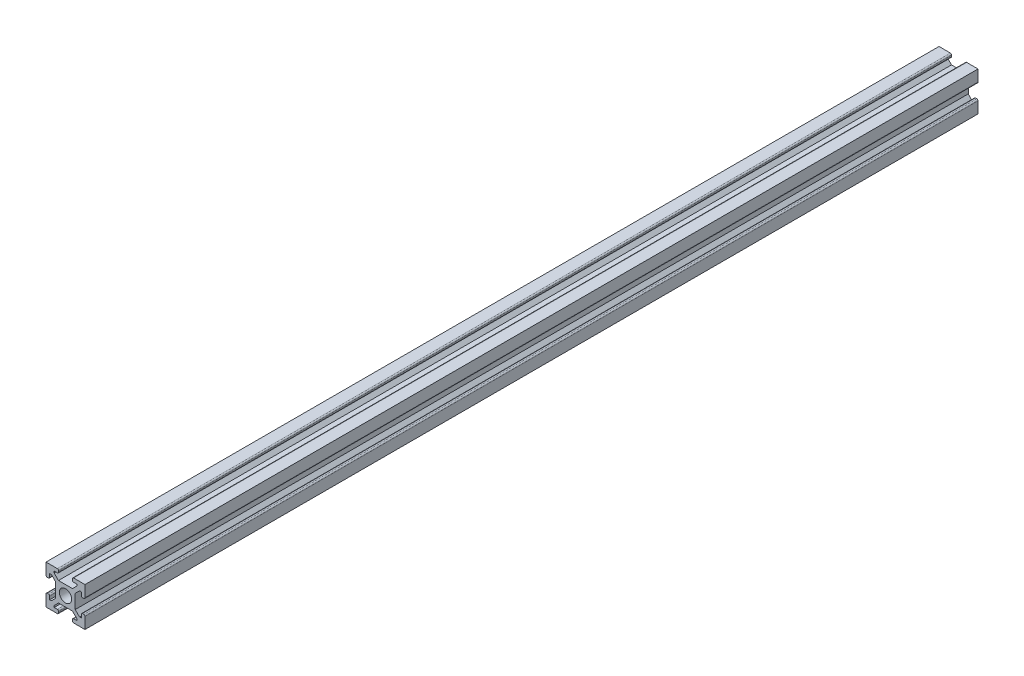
ISO-10303-21;
HEADER;
FILE_DESCRIPTION(('STEP AP214'),'2;1');
FILE_NAME('part.step','',(''),(''),'','','');
FILE_SCHEMA(('AUTOMOTIVE_DESIGN { 1 0 10303 214 1 1 1 1 }'));
ENDSEC;
DATA;
#1=APPLICATION_CONTEXT('core data for automotive mechanical design processes');
#2=APPLICATION_PROTOCOL_DEFINITION('international standard','automotive_design',2000,#1);
#3=PRODUCT_CONTEXT('',#1,'mechanical');
#4=PRODUCT('Part','Part','',(#3));
#5=PRODUCT_RELATED_PRODUCT_CATEGORY('part','',(#4));
#6=PRODUCT_DEFINITION_FORMATION('','',#4);
#7=PRODUCT_DEFINITION_CONTEXT('part definition',#1,'design');
#8=PRODUCT_DEFINITION('design','',#6,#7);
#9=PRODUCT_DEFINITION_SHAPE('','',#8);
#10=(LENGTH_UNIT() NAMED_UNIT(*) SI_UNIT(.MILLI.,.METRE.));
#11=(NAMED_UNIT(*) PLANE_ANGLE_UNIT() SI_UNIT($,.RADIAN.));
#12=(NAMED_UNIT(*) SI_UNIT($,.STERADIAN.) SOLID_ANGLE_UNIT());
#13=UNCERTAINTY_MEASURE_WITH_UNIT(LENGTH_MEASURE(1.E-05),#10,'distance_accuracy_value','');
#14=(GEOMETRIC_REPRESENTATION_CONTEXT(3) GLOBAL_UNCERTAINTY_ASSIGNED_CONTEXT((#13)) GLOBAL_UNIT_ASSIGNED_CONTEXT((#10,
#11,#12)) REPRESENTATION_CONTEXT('',''));
#15=CARTESIAN_POINT('',(0.,0.,0.));
#16=DIRECTION('',(0.,0.,1.));
#17=DIRECTION('',(1.,0.,0.));
#18=AXIS2_PLACEMENT_3D('',#15,#16,#17);
#19=CARTESIAN_POINT('',(0.131681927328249,0.,919.736032));
#20=DIRECTION('',(1.,0.,0.));
#21=DIRECTION('',(0.,0.,-1.));
#22=AXIS2_PLACEMENT_3D('',#19,#20,#21);
#23=PLANE('',#22);
#24=DIRECTION('',(0.,-1.,0.));
#25=VECTOR('',#24,1.);
#26=CARTESIAN_POINT('',(0.131681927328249,0.,0.));
#27=LINE('',#26,#25);
#28=CARTESIAN_POINT('',(0.131681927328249,17.5693541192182,0.));
#29=VERTEX_POINT('',#28);
#30=CARTESIAN_POINT('',(0.131681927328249,3.10692773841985,0.));
#31=VERTEX_POINT('',#30);
#32=EDGE_CURVE('E427',#29,#31,#27,.T.);
#33=ORIENTED_EDGE('',*,*,#32,.F.);
#34=DIRECTION('',(0.,0.,-1.));
#35=VECTOR('',#34,1.);
#36=CARTESIAN_POINT('',(0.131681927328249,17.5693541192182,919.736032));
#37=LINE('',#36,#35);
#38=CARTESIAN_POINT('',(0.131681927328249,17.5693541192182,919.736032));
#39=VERTEX_POINT('',#38);
#40=EDGE_CURVE('E421',#39,#29,#37,.T.);
#41=ORIENTED_EDGE('',*,*,#40,.F.);
#42=DIRECTION('',(0.,-1.,0.));
#43=VECTOR('',#42,1.);
#44=CARTESIAN_POINT('',(0.131681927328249,0.,919.736032));
#45=LINE('',#44,#43);
#46=CARTESIAN_POINT('',(0.131681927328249,3.10692773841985,919.736032));
#47=VERTEX_POINT('',#46);
#48=EDGE_CURVE('E424',#39,#47,#45,.T.);
#49=ORIENTED_EDGE('',*,*,#48,.T.);
#50=DIRECTION('',(0.,0.,-1.));
#51=VECTOR('',#50,1.);
#52=CARTESIAN_POINT('',(0.131681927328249,3.10692773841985,919.736032));
#53=LINE('',#52,#51);
#54=EDGE_CURVE('E608',#47,#31,#53,.T.);
#55=ORIENTED_EDGE('',*,*,#54,.T.);
#56=EDGE_LOOP('',(#33,#41,#49,#55));
#57=FACE_BOUND('',#56,.T.);
#58=ADVANCED_FACE('F41',(#57),#23,.T.);
#59=CARTESIAN_POINT('',(-8.71883609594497,8.71883609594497,919.736032));
#60=DIRECTION('',(-0.707106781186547,0.707106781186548,0.));
#61=DIRECTION('',(-0.707106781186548,-0.707106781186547,0.));
#62=AXIS2_PLACEMENT_3D('',#59,#60,#61);
#63=PLANE('',#62);
#64=DIRECTION('',(0.707106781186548,0.707106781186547,0.));
#65=VECTOR('',#64,1.);
#66=CARTESIAN_POINT('',(-8.71883609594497,8.71883609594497,0.));
#67=LINE('',#66,#65);
#68=CARTESIAN_POINT('',(4.57668192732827,22.0143541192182,0.));
#69=VERTEX_POINT('',#68);
#70=EDGE_CURVE('E611',#29,#69,#67,.T.);
#71=ORIENTED_EDGE('',*,*,#70,.T.);
#72=DIRECTION('',(0.,0.,-1.));
#73=VECTOR('',#72,1.);
#74=CARTESIAN_POINT('',(4.57668192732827,22.0143541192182,919.736032));
#75=LINE('',#74,#73);
#76=CARTESIAN_POINT('',(4.57668192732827,22.0143541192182,919.736032));
#77=VERTEX_POINT('',#76);
#78=EDGE_CURVE('E432',#77,#69,#75,.T.);
#79=ORIENTED_EDGE('',*,*,#78,.F.);
#80=DIRECTION('',(0.707106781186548,0.707106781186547,0.));
#81=VECTOR('',#80,1.);
#82=CARTESIAN_POINT('',(-8.71883609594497,8.71883609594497,919.736032));
#83=LINE('',#82,#81);
#84=EDGE_CURVE('E435',#39,#77,#83,.T.);
#85=ORIENTED_EDGE('',*,*,#84,.F.);
#86=ORIENTED_EDGE('',*,*,#40,.T.);
#87=EDGE_LOOP('',(#71,#79,#85,#86));
#88=FACE_BOUND('',#87,.T.);
#89=ADVANCED_FACE('F436',(#88),#63,.F.);
#90=CARTESIAN_POINT('',(1.71828197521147E-13,22.0143541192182,919.736032));
#91=DIRECTION('',(0.,1.,0.));
#92=DIRECTION('',(-1.,0.,0.));
#93=AXIS2_PLACEMENT_3D('',#90,#91,#92);
#94=PLANE('',#93);
#95=DIRECTION('',(1.,0.,0.));
#96=VECTOR('',#95,1.);
#97=CARTESIAN_POINT('',(1.71828197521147E-13,22.0143541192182,0.));
#98=LINE('',#97,#96);
#99=CARTESIAN_POINT('',(6.35468192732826,22.0143541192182,0.));
#100=VERTEX_POINT('',#99);
#101=EDGE_CURVE('E614',#69,#100,#98,.T.);
#102=ORIENTED_EDGE('',*,*,#101,.T.);
#103=DIRECTION('',(0.,0.,-1.));
#104=VECTOR('',#103,1.);
#105=CARTESIAN_POINT('',(6.35468192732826,22.0143541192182,919.736032));
#106=LINE('',#105,#104);
#107=CARTESIAN_POINT('',(6.35468192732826,22.0143541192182,919.736032));
#108=VERTEX_POINT('',#107);
#109=EDGE_CURVE('E853',#108,#100,#106,.T.);
#110=ORIENTED_EDGE('',*,*,#109,.F.);
#111=DIRECTION('',(1.,0.,0.));
#112=VECTOR('',#111,1.);
#113=CARTESIAN_POINT('',(1.71828197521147E-13,22.0143541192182,919.736032));
#114=LINE('',#113,#112);
#115=EDGE_CURVE('E441',#77,#108,#114,.T.);
#116=ORIENTED_EDGE('',*,*,#115,.F.);
#117=ORIENTED_EDGE('',*,*,#78,.T.);
#118=EDGE_LOOP('',(#102,#110,#116,#117));
#119=FACE_BOUND('',#118,.T.);
#120=ADVANCED_FACE('F1284',(#119),#94,.F.);
#121=CARTESIAN_POINT('',(6.35468192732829,0.,919.736032));
#122=DIRECTION('',(-1.,0.,0.));
#123=DIRECTION('',(0.,-1.,0.));
#124=AXIS2_PLACEMENT_3D('',#121,#122,#123);
#125=PLANE('',#124);
#126=DIRECTION('',(0.,1.,0.));
#127=VECTOR('',#126,1.);
#128=CARTESIAN_POINT('',(6.35468192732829,0.,0.));
#129=LINE('',#128,#127);
#130=CARTESIAN_POINT('',(6.35468192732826,18.7123541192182,0.));
#131=VERTEX_POINT('',#130);
#132=EDGE_CURVE('E618',#131,#100,#129,.T.);
#133=ORIENTED_EDGE('',*,*,#132,.F.);
#134=DIRECTION('',(0.,0.,-1.));
#135=VECTOR('',#134,1.);
#136=CARTESIAN_POINT('',(6.35468192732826,18.7123541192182,919.736032));
#137=LINE('',#136,#135);
#138=CARTESIAN_POINT('',(6.35468192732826,18.7123541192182,919.736032));
#139=VERTEX_POINT('',#138);
#140=EDGE_CURVE('E1019',#131,#139,#137,.F.);
#141=ORIENTED_EDGE('',*,*,#140,.T.);
#142=DIRECTION('',(0.,1.,0.));
#143=VECTOR('',#142,1.);
#144=CARTESIAN_POINT('',(6.35468192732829,0.,919.736032));
#145=LINE('',#144,#143);
#146=EDGE_CURVE('E459',#139,#108,#145,.T.);
#147=ORIENTED_EDGE('',*,*,#146,.T.);
#148=ORIENTED_EDGE('',*,*,#109,.T.);
#149=EDGE_LOOP('',(#133,#141,#147,#148));
#150=FACE_BOUND('',#149,.T.);
#151=ADVANCED_FACE('F1313',(#150),#125,.T.);
#152=CARTESIAN_POINT('',(0.,17.4423541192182,919.736032));
#153=DIRECTION('',(0.,-1.,0.));
#154=DIRECTION('',(1.,0.,0.));
#155=AXIS2_PLACEMENT_3D('',#152,#153,#154);
#156=PLANE('',#155);
#157=DIRECTION('',(-1.,0.,0.));
#158=VECTOR('',#157,1.);
#159=CARTESIAN_POINT('',(0.,17.4423541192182,0.));
#160=LINE('',#159,#158);
#161=CARTESIAN_POINT('',(8.89468192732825,17.4423541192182,0.));
#162=VERTEX_POINT('',#161);
#163=CARTESIAN_POINT('',(7.62468192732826,17.4423541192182,0.));
#164=VERTEX_POINT('',#163);
#165=EDGE_CURVE('E621',#162,#164,#160,.T.);
#166=ORIENTED_EDGE('',*,*,#165,.F.);
#167=DIRECTION('',(0.,0.,-1.));
#168=VECTOR('',#167,1.);
#169=CARTESIAN_POINT('',(8.89468192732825,17.4423541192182,919.736032));
#170=LINE('',#169,#168);
#171=CARTESIAN_POINT('',(8.89468192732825,17.4423541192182,919.736032));
#172=VERTEX_POINT('',#171);
#173=EDGE_CURVE('E1016',#162,#172,#170,.F.);
#174=ORIENTED_EDGE('',*,*,#173,.T.);
#175=DIRECTION('',(-1.,0.,0.));
#176=VECTOR('',#175,1.);
#177=CARTESIAN_POINT('',(0.,17.4423541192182,919.736032));
#178=LINE('',#177,#176);
#179=CARTESIAN_POINT('',(7.62468192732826,17.4423541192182,919.736032));
#180=VERTEX_POINT('',#179);
#181=EDGE_CURVE('E462',#172,#180,#178,.T.);
#182=ORIENTED_EDGE('',*,*,#181,.T.);
#183=DIRECTION('',(0.,0.,-1.));
#184=VECTOR('',#183,1.);
#185=CARTESIAN_POINT('',(7.62468192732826,17.4423541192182,919.736032));
#186=LINE('',#185,#184);
#187=EDGE_CURVE('E1012',#180,#164,#186,.T.);
#188=ORIENTED_EDGE('',*,*,#187,.T.);
#189=EDGE_LOOP('',(#166,#174,#182,#188));
#190=FACE_BOUND('',#189,.T.);
#191=ADVANCED_FACE('F1296',(#190),#156,.T.);
#192=CARTESIAN_POINT('',(10.1646819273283,0.,919.736032));
#193=DIRECTION('',(1.,0.,0.));
#194=DIRECTION('',(0.,0.,-1.));
#195=AXIS2_PLACEMENT_3D('',#192,#193,#194);
#196=PLANE('',#195);
#197=DIRECTION('',(0.,-1.,0.));
#198=VECTOR('',#197,1.);
#199=CARTESIAN_POINT('',(10.1646819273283,0.,919.736032));
#200=LINE('',#199,#198);
#201=CARTESIAN_POINT('',(10.1646819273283,30.404140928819,919.736032));
#202=VERTEX_POINT('',#201);
#203=CARTESIAN_POINT('',(10.1646819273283,18.7123541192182,919.736032));
#204=VERTEX_POINT('',#203);
#205=EDGE_CURVE('E466',#202,#204,#200,.T.);
#206=ORIENTED_EDGE('',*,*,#205,.T.);
#207=DIRECTION('',(0.,0.,-1.));
#208=VECTOR('',#207,1.);
#209=CARTESIAN_POINT('',(10.1646819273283,18.7123541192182,919.736032));
#210=LINE('',#209,#208);
#211=CARTESIAN_POINT('',(10.1646819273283,18.7123541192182,0.));
#212=VERTEX_POINT('',#211);
#213=EDGE_CURVE('E1008',#204,#212,#210,.T.);
#214=ORIENTED_EDGE('',*,*,#213,.T.);
#215=DIRECTION('',(0.,-1.,0.));
#216=VECTOR('',#215,1.);
#217=CARTESIAN_POINT('',(10.1646819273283,0.,0.));
#218=LINE('',#217,#216);
#219=CARTESIAN_POINT('',(10.1646819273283,30.404140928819,0.));
#220=VERTEX_POINT('',#219);
#221=EDGE_CURVE('E625',#220,#212,#218,.T.);
#222=ORIENTED_EDGE('',*,*,#221,.F.);
#223=DIRECTION('',(0.,0.,-1.));
#224=VECTOR('',#223,1.);
#225=CARTESIAN_POINT('',(10.1646819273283,30.404140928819,919.736032));
#226=LINE('',#225,#224);
#227=EDGE_CURVE('E849',#202,#220,#226,.T.);
#228=ORIENTED_EDGE('',*,*,#227,.F.);
#229=EDGE_LOOP('',(#206,#214,#222,#228));
#230=FACE_BOUND('',#229,.T.);
#231=ADVANCED_FACE('F1305',(#230),#196,.T.);
#232=CARTESIAN_POINT('',(0.,30.404140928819,919.736032));
#233=DIRECTION('',(0.,1.,0.));
#234=DIRECTION('',(0.,0.,1.));
#235=AXIS2_PLACEMENT_3D('',#232,#233,#234);
#236=PLANE('',#235);
#237=DIRECTION('',(1.,0.,0.));
#238=VECTOR('',#237,1.);
#239=CARTESIAN_POINT('',(0.,30.404140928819,0.));
#240=LINE('',#239,#238);
#241=CARTESIAN_POINT('',(-1.52710488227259,30.404140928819,0.));
#242=VERTEX_POINT('',#241);
#243=EDGE_CURVE('E629',#242,#220,#240,.T.);
#244=ORIENTED_EDGE('',*,*,#243,.F.);
#245=DIRECTION('',(0.,0.,-1.));
#246=VECTOR('',#245,1.);
#247=CARTESIAN_POINT('',(-1.52710488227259,30.404140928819,919.736032));
#248=LINE('',#247,#246);
#249=CARTESIAN_POINT('',(-1.52710488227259,30.404140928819,919.736032));
#250=VERTEX_POINT('',#249);
#251=EDGE_CURVE('E50',#242,#250,#248,.F.);
#252=ORIENTED_EDGE('',*,*,#251,.T.);
#253=DIRECTION('',(1.,0.,0.));
#254=VECTOR('',#253,1.);
#255=CARTESIAN_POINT('',(0.,30.404140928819,919.736032));
#256=LINE('',#255,#254);
#257=EDGE_CURVE('E470',#250,#202,#256,.T.);
#258=ORIENTED_EDGE('',*,*,#257,.T.);
#259=ORIENTED_EDGE('',*,*,#227,.T.);
#260=EDGE_LOOP('',(#244,#252,#258,#259));
#261=FACE_BOUND('',#260,.T.);
#262=ADVANCED_FACE('F1061',(#261),#236,.T.);
#263=CARTESIAN_POINT('',(-2.79710488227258,0.,919.736032));
#264=DIRECTION('',(1.,0.,0.));
#265=DIRECTION('',(0.,1.,0.));
#266=AXIS2_PLACEMENT_3D('',#263,#264,#265);
#267=PLANE('',#266);
#268=DIRECTION('',(0.,-1.,0.));
#269=VECTOR('',#268,1.);
#270=CARTESIAN_POINT('',(-2.79710488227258,0.,919.736032));
#271=LINE('',#270,#269);
#272=CARTESIAN_POINT('',(-2.79710488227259,29.134140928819,919.736032));
#273=VERTEX_POINT('',#272);
#274=CARTESIAN_POINT('',(-2.79710488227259,27.864140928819,919.736032));
#275=VERTEX_POINT('',#274);
#276=EDGE_CURVE('E473',#273,#275,#271,.T.);
#277=ORIENTED_EDGE('',*,*,#276,.F.);
#278=DIRECTION('',(0.,0.,-1.));
#279=VECTOR('',#278,1.);
#280=CARTESIAN_POINT('',(-2.79710488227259,29.134140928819,0.));
#281=LINE('',#280,#279);
#282=CARTESIAN_POINT('',(-2.79710488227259,29.134140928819,0.));
#283=VERTEX_POINT('',#282);
#284=EDGE_CURVE('E1053',#273,#283,#281,.T.);
#285=ORIENTED_EDGE('',*,*,#284,.T.);
#286=DIRECTION('',(0.,-1.,0.));
#287=VECTOR('',#286,1.);
#288=CARTESIAN_POINT('',(-2.79710488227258,0.,0.));
#289=LINE('',#288,#287);
#290=CARTESIAN_POINT('',(-2.79710488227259,27.864140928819,0.));
#291=VERTEX_POINT('',#290);
#292=EDGE_CURVE('E632',#283,#291,#289,.T.);
#293=ORIENTED_EDGE('',*,*,#292,.T.);
#294=DIRECTION('',(0.,0.,-1.));
#295=VECTOR('',#294,1.);
#296=CARTESIAN_POINT('',(-2.79710488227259,27.864140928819,919.736032));
#297=LINE('',#296,#295);
#298=EDGE_CURVE('E1050',#291,#275,#297,.F.);
#299=ORIENTED_EDGE('',*,*,#298,.T.);
#300=EDGE_LOOP('',(#277,#285,#293,#299));
#301=FACE_BOUND('',#300,.T.);
#302=ADVANCED_FACE('F1071',(#301),#267,.F.);
#303=CARTESIAN_POINT('',(0.,26.594140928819,919.736032));
#304=DIRECTION('',(0.,1.,0.));
#305=DIRECTION('',(0.,0.,1.));
#306=AXIS2_PLACEMENT_3D('',#303,#304,#305);
#307=PLANE('',#306);
#308=DIRECTION('',(1.,0.,0.));
#309=VECTOR('',#308,1.);
#310=CARTESIAN_POINT('',(0.,26.594140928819,919.736032));
#311=LINE('',#310,#309);
#312=CARTESIAN_POINT('',(-1.52710488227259,26.594140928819,919.736032));
#313=VERTEX_POINT('',#312);
#314=CARTESIAN_POINT('',(1.77489511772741,26.594140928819,919.736032));
#315=VERTEX_POINT('',#314);
#316=EDGE_CURVE('E477',#313,#315,#311,.T.);
#317=ORIENTED_EDGE('',*,*,#316,.F.);
#318=DIRECTION('',(0.,0.,-1.));
#319=VECTOR('',#318,1.);
#320=CARTESIAN_POINT('',(-1.52710488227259,26.594140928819,919.736032));
#321=LINE('',#320,#319);
#322=CARTESIAN_POINT('',(-1.52710488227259,26.594140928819,0.));
#323=VERTEX_POINT('',#322);
#324=EDGE_CURVE('E11',#313,#323,#321,.T.);
#325=ORIENTED_EDGE('',*,*,#324,.T.);
#326=DIRECTION('',(1.,0.,0.));
#327=VECTOR('',#326,1.);
#328=CARTESIAN_POINT('',(0.,26.594140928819,0.));
#329=LINE('',#328,#327);
#330=CARTESIAN_POINT('',(1.77489511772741,26.594140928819,0.));
#331=VERTEX_POINT('',#330);
#332=EDGE_CURVE('E636',#323,#331,#329,.T.);
#333=ORIENTED_EDGE('',*,*,#332,.T.);
#334=DIRECTION('',(0.,0.,-1.));
#335=VECTOR('',#334,1.);
#336=CARTESIAN_POINT('',(1.77489511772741,26.594140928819,919.736032));
#337=LINE('',#336,#335);
#338=EDGE_CURVE('E845',#315,#331,#337,.T.);
#339=ORIENTED_EDGE('',*,*,#338,.F.);
#340=EDGE_LOOP('',(#317,#325,#333,#339));
#341=FACE_BOUND('',#340,.T.);
#342=ADVANCED_FACE('F1083',(#341),#307,.F.);
#343=CARTESIAN_POINT('',(1.77489511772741,0.,919.736032));
#344=DIRECTION('',(-1.,0.,0.));
#345=DIRECTION('',(0.,0.,1.));
#346=AXIS2_PLACEMENT_3D('',#343,#344,#345);
#347=PLANE('',#346);
#348=DIRECTION('',(0.,1.,0.));
#349=VECTOR('',#348,1.);
#350=CARTESIAN_POINT('',(1.77489511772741,0.,0.));
#351=LINE('',#350,#349);
#352=CARTESIAN_POINT('',(1.77489511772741,24.816140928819,0.));
#353=VERTEX_POINT('',#352);
#354=EDGE_CURVE('E639',#353,#331,#351,.T.);
#355=ORIENTED_EDGE('',*,*,#354,.F.);
#356=DIRECTION('',(0.,0.,-1.));
#357=VECTOR('',#356,1.);
#358=CARTESIAN_POINT('',(1.77489511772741,24.816140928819,919.736032));
#359=LINE('',#358,#357);
#360=CARTESIAN_POINT('',(1.77489511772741,24.816140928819,919.736032));
#361=VERTEX_POINT('',#360);
#362=EDGE_CURVE('E842',#361,#353,#359,.T.);
#363=ORIENTED_EDGE('',*,*,#362,.F.);
#364=DIRECTION('',(0.,1.,0.));
#365=VECTOR('',#364,1.);
#366=CARTESIAN_POINT('',(1.77489511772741,0.,919.736032));
#367=LINE('',#366,#365);
#368=EDGE_CURVE('E480',#361,#315,#367,.T.);
#369=ORIENTED_EDGE('',*,*,#368,.T.);
#370=ORIENTED_EDGE('',*,*,#338,.T.);
#371=EDGE_LOOP('',(#355,#363,#369,#370));
#372=FACE_BOUND('',#371,.T.);
#373=ADVANCED_FACE('F1636',(#372),#347,.T.);
#374=CARTESIAN_POINT('',(-11.5206229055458,11.5206229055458,919.736032));
#375=DIRECTION('',(-0.707106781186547,0.707106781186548,0.));
#376=DIRECTION('',(-0.707106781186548,-0.707106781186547,0.));
#377=AXIS2_PLACEMENT_3D('',#374,#375,#376);
#378=PLANE('',#377);
#379=DIRECTION('',(0.707106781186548,0.707106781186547,0.));
#380=VECTOR('',#379,1.);
#381=CARTESIAN_POINT('',(-11.5206229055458,11.5206229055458,0.));
#382=LINE('',#381,#380);
#383=CARTESIAN_POINT('',(-2.67010488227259,20.371140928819,0.));
#384=VERTEX_POINT('',#383);
#385=EDGE_CURVE('E643',#384,#353,#382,.T.);
#386=ORIENTED_EDGE('',*,*,#385,.F.);
#387=DIRECTION('',(0.,0.,-1.));
#388=VECTOR('',#387,1.);
#389=CARTESIAN_POINT('',(-2.67010488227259,20.371140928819,919.736032));
#390=LINE('',#389,#388);
#391=CARTESIAN_POINT('',(-2.67010488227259,20.371140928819,919.736032));
#392=VERTEX_POINT('',#391);
#393=EDGE_CURVE('E839',#392,#384,#390,.T.);
#394=ORIENTED_EDGE('',*,*,#393,.F.);
#395=DIRECTION('',(0.707106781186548,0.707106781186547,0.));
#396=VECTOR('',#395,1.);
#397=CARTESIAN_POINT('',(-11.5206229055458,11.5206229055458,919.736032));
#398=LINE('',#397,#396);
#399=EDGE_CURVE('E484',#392,#361,#398,.T.);
#400=ORIENTED_EDGE('',*,*,#399,.T.);
#401=ORIENTED_EDGE('',*,*,#362,.T.);
#402=EDGE_LOOP('',(#386,#394,#400,#401));
#403=FACE_BOUND('',#402,.T.);
#404=ADVANCED_FACE('F1091',(#403),#378,.T.);
#405=CARTESIAN_POINT('',(0.,20.371140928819,919.736032));
#406=DIRECTION('',(0.,1.,0.));
#407=DIRECTION('',(0.,0.,1.));
#408=AXIS2_PLACEMENT_3D('',#405,#406,#407);
#409=PLANE('',#408);
#410=DIRECTION('',(1.,0.,0.));
#411=VECTOR('',#410,1.);
#412=CARTESIAN_POINT('',(0.,20.371140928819,0.));
#413=LINE('',#412,#411);
#414=CARTESIAN_POINT('',(-17.1325312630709,20.371140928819,0.));
#415=VERTEX_POINT('',#414);
#416=EDGE_CURVE('E647',#415,#384,#413,.T.);
#417=ORIENTED_EDGE('',*,*,#416,.F.);
#418=DIRECTION('',(0.,0.,-1.));
#419=VECTOR('',#418,1.);
#420=CARTESIAN_POINT('',(-17.1325312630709,20.371140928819,919.736032));
#421=LINE('',#420,#419);
#422=CARTESIAN_POINT('',(-17.1325312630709,20.371140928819,919.736032));
#423=VERTEX_POINT('',#422);
#424=EDGE_CURVE('E836',#423,#415,#421,.T.);
#425=ORIENTED_EDGE('',*,*,#424,.F.);
#426=DIRECTION('',(1.,0.,0.));
#427=VECTOR('',#426,1.);
#428=CARTESIAN_POINT('',(0.,20.371140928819,919.736032));
#429=LINE('',#428,#427);
#430=EDGE_CURVE('E488',#423,#392,#429,.T.);
#431=ORIENTED_EDGE('',*,*,#430,.T.);
#432=ORIENTED_EDGE('',*,*,#393,.T.);
#433=EDGE_LOOP('',(#417,#425,#431,#432));
#434=FACE_BOUND('',#433,.T.);
#435=ADVANCED_FACE('F1095',(#434),#409,.T.);
#436=CARTESIAN_POINT('',(1.61930483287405,1.61930483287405,919.736032));
#437=DIRECTION('',(-0.707106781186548,-0.707106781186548,0.));
#438=DIRECTION('',(0.707106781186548,-0.707106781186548,0.));
#439=AXIS2_PLACEMENT_3D('',#436,#437,#438);
#440=PLANE('',#439);
#441=DIRECTION('',(-0.707106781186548,0.707106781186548,0.));
#442=VECTOR('',#441,1.);
#443=CARTESIAN_POINT('',(1.61930483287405,1.61930483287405,0.));
#444=LINE('',#443,#442);
#445=CARTESIAN_POINT('',(-21.5775312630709,24.816140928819,0.));
#446=VERTEX_POINT('',#445);
#447=EDGE_CURVE('E651',#415,#446,#444,.T.);
#448=ORIENTED_EDGE('',*,*,#447,.T.);
#449=DIRECTION('',(0.,0.,-1.));
#450=VECTOR('',#449,1.);
#451=CARTESIAN_POINT('',(-21.5775312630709,24.816140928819,919.736032));
#452=LINE('',#451,#450);
#453=CARTESIAN_POINT('',(-21.5775312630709,24.816140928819,919.736032));
#454=VERTEX_POINT('',#453);
#455=EDGE_CURVE('E832',#454,#446,#452,.T.);
#456=ORIENTED_EDGE('',*,*,#455,.F.);
#457=DIRECTION('',(-0.707106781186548,0.707106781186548,0.));
#458=VECTOR('',#457,1.);
#459=CARTESIAN_POINT('',(1.61930483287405,1.61930483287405,919.736032));
#460=LINE('',#459,#458);
#461=EDGE_CURVE('E492',#423,#454,#460,.T.);
#462=ORIENTED_EDGE('',*,*,#461,.F.);
#463=ORIENTED_EDGE('',*,*,#424,.T.);
#464=EDGE_LOOP('',(#448,#456,#462,#463));
#465=FACE_BOUND('',#464,.T.);
#466=ADVANCED_FACE('F1102',(#465),#440,.F.);
#467=CARTESIAN_POINT('',(-21.5775312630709,0.,919.736032));
#468=DIRECTION('',(-1.,0.,0.));
#469=DIRECTION('',(0.,0.,1.));
#470=AXIS2_PLACEMENT_3D('',#467,#468,#469);
#471=PLANE('',#470);
#472=DIRECTION('',(0.,1.,0.));
#473=VECTOR('',#472,1.);
#474=CARTESIAN_POINT('',(-21.5775312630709,0.,0.));
#475=LINE('',#474,#473);
#476=CARTESIAN_POINT('',(-21.5775312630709,26.594140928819,0.));
#477=VERTEX_POINT('',#476);
#478=EDGE_CURVE('E654',#446,#477,#475,.T.);
#479=ORIENTED_EDGE('',*,*,#478,.T.);
#480=DIRECTION('',(0.,0.,-1.));
#481=VECTOR('',#480,1.);
#482=CARTESIAN_POINT('',(-21.5775312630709,26.594140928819,919.736032));
#483=LINE('',#482,#481);
#484=CARTESIAN_POINT('',(-21.5775312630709,26.594140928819,919.736032));
#485=VERTEX_POINT('',#484);
#486=EDGE_CURVE('E828',#485,#477,#483,.T.);
#487=ORIENTED_EDGE('',*,*,#486,.F.);
#488=DIRECTION('',(0.,1.,0.));
#489=VECTOR('',#488,1.);
#490=CARTESIAN_POINT('',(-21.5775312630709,0.,919.736032));
#491=LINE('',#490,#489);
#492=EDGE_CURVE('E495',#454,#485,#491,.T.);
#493=ORIENTED_EDGE('',*,*,#492,.F.);
#494=ORIENTED_EDGE('',*,*,#455,.T.);
#495=EDGE_LOOP('',(#479,#487,#493,#494));
#496=FACE_BOUND('',#495,.T.);
#497=ADVANCED_FACE('F1106',(#496),#471,.F.);
#498=CARTESIAN_POINT('',(0.,26.594140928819,919.736032));
#499=DIRECTION('',(0.,-1.,0.));
#500=DIRECTION('',(0.,0.,-1.));
#501=AXIS2_PLACEMENT_3D('',#498,#499,#500);
#502=PLANE('',#501);
#503=DIRECTION('',(-1.,0.,0.));
#504=VECTOR('',#503,1.);
#505=CARTESIAN_POINT('',(0.,26.594140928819,0.));
#506=LINE('',#505,#504);
#507=CARTESIAN_POINT('',(-18.2755312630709,26.594140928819,0.));
#508=VERTEX_POINT('',#507);
#509=EDGE_CURVE('E658',#508,#477,#506,.T.);
#510=ORIENTED_EDGE('',*,*,#509,.F.);
#511=DIRECTION('',(0.,0.,-1.));
#512=VECTOR('',#511,1.);
#513=CARTESIAN_POINT('',(-18.2755312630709,26.594140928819,919.736032));
#514=LINE('',#513,#512);
#515=CARTESIAN_POINT('',(-18.2755312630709,26.594140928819,919.736032));
#516=VERTEX_POINT('',#515);
#517=EDGE_CURVE('E1043',#508,#516,#514,.F.);
#518=ORIENTED_EDGE('',*,*,#517,.T.);
#519=DIRECTION('',(-1.,0.,0.));
#520=VECTOR('',#519,1.);
#521=CARTESIAN_POINT('',(0.,26.594140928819,919.736032));
#522=LINE('',#521,#520);
#523=EDGE_CURVE('E499',#516,#485,#522,.T.);
#524=ORIENTED_EDGE('',*,*,#523,.T.);
#525=ORIENTED_EDGE('',*,*,#486,.T.);
#526=EDGE_LOOP('',(#510,#518,#524,#525));
#527=FACE_BOUND('',#526,.T.);
#528=ADVANCED_FACE('F1109',(#527),#502,.T.);
#529=CARTESIAN_POINT('',(-17.0055312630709,0.,919.736032));
#530=DIRECTION('',(1.,0.,0.));
#531=DIRECTION('',(0.,0.,-1.));
#532=AXIS2_PLACEMENT_3D('',#529,#530,#531);
#533=PLANE('',#532);
#534=DIRECTION('',(0.,-1.,0.));
#535=VECTOR('',#534,1.);
#536=CARTESIAN_POINT('',(-17.0055312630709,0.,919.736032));
#537=LINE('',#536,#535);
#538=CARTESIAN_POINT('',(-17.0055312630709,29.134140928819,919.736032));
#539=VERTEX_POINT('',#538);
#540=CARTESIAN_POINT('',(-17.0055312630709,27.864140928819,919.736032));
#541=VERTEX_POINT('',#540);
#542=EDGE_CURVE('E502',#539,#541,#537,.T.);
#543=ORIENTED_EDGE('',*,*,#542,.T.);
#544=DIRECTION('',(0.,0.,-1.));
#545=VECTOR('',#544,1.);
#546=CARTESIAN_POINT('',(-17.0055312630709,27.864140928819,919.736032));
#547=LINE('',#546,#545);
#548=CARTESIAN_POINT('',(-17.0055312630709,27.864140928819,0.));
#549=VERTEX_POINT('',#548);
#550=EDGE_CURVE('E1039',#541,#549,#547,.T.);
#551=ORIENTED_EDGE('',*,*,#550,.T.);
#552=DIRECTION('',(0.,-1.,0.));
#553=VECTOR('',#552,1.);
#554=CARTESIAN_POINT('',(-17.0055312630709,0.,0.));
#555=LINE('',#554,#553);
#556=CARTESIAN_POINT('',(-17.0055312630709,29.134140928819,0.));
#557=VERTEX_POINT('',#556);
#558=EDGE_CURVE('E661',#557,#549,#555,.T.);
#559=ORIENTED_EDGE('',*,*,#558,.F.);
#560=DIRECTION('',(0.,0.,-1.));
#561=VECTOR('',#560,1.);
#562=CARTESIAN_POINT('',(-17.0055312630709,29.134140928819,919.736032));
#563=LINE('',#562,#561);
#564=EDGE_CURVE('E1036',#557,#539,#563,.F.);
#565=ORIENTED_EDGE('',*,*,#564,.T.);
#566=EDGE_LOOP('',(#543,#551,#559,#565));
#567=FACE_BOUND('',#566,.T.);
#568=ADVANCED_FACE('F1118',(#567),#533,.T.);
#569=CARTESIAN_POINT('',(0.,30.404140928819,919.736032));
#570=DIRECTION('',(0.,1.,0.));
#571=DIRECTION('',(0.,0.,1.));
#572=AXIS2_PLACEMENT_3D('',#569,#570,#571);
#573=PLANE('',#572);
#574=DIRECTION('',(1.,0.,0.));
#575=VECTOR('',#574,1.);
#576=CARTESIAN_POINT('',(0.,30.404140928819,919.736032));
#577=LINE('',#576,#575);
#578=CARTESIAN_POINT('',(-29.9673180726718,30.404140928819,919.736032));
#579=VERTEX_POINT('',#578);
#580=CARTESIAN_POINT('',(-18.2755312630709,30.404140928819,919.736032));
#581=VERTEX_POINT('',#580);
#582=EDGE_CURVE('E506',#579,#581,#577,.T.);
#583=ORIENTED_EDGE('',*,*,#582,.T.);
#584=DIRECTION('',(0.,0.,-1.));
#585=VECTOR('',#584,1.);
#586=CARTESIAN_POINT('',(-18.2755312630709,30.404140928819,919.736032));
#587=LINE('',#586,#585);
#588=CARTESIAN_POINT('',(-18.2755312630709,30.404140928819,0.));
#589=VERTEX_POINT('',#588);
#590=EDGE_CURVE('E1046',#581,#589,#587,.T.);
#591=ORIENTED_EDGE('',*,*,#590,.T.);
#592=DIRECTION('',(1.,0.,0.));
#593=VECTOR('',#592,1.);
#594=CARTESIAN_POINT('',(0.,30.404140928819,0.));
#595=LINE('',#594,#593);
#596=CARTESIAN_POINT('',(-29.9673180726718,30.404140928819,0.));
#597=VERTEX_POINT('',#596);
#598=EDGE_CURVE('E665',#597,#589,#595,.T.);
#599=ORIENTED_EDGE('',*,*,#598,.F.);
#600=DIRECTION('',(0.,0.,-1.));
#601=VECTOR('',#600,1.);
#602=CARTESIAN_POINT('',(-29.9673180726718,30.404140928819,919.736032));
#603=LINE('',#602,#601);
#604=EDGE_CURVE('E825',#579,#597,#603,.T.);
#605=ORIENTED_EDGE('',*,*,#604,.F.);
#606=EDGE_LOOP('',(#583,#591,#599,#605));
#607=FACE_BOUND('',#606,.T.);
#608=ADVANCED_FACE('F1127',(#607),#573,.T.);
#609=CARTESIAN_POINT('',(-29.9673180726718,0.,919.736032));
#610=DIRECTION('',(1.,0.,0.));
#611=DIRECTION('',(0.,0.,-1.));
#612=AXIS2_PLACEMENT_3D('',#609,#610,#611);
#613=PLANE('',#612);
#614=DIRECTION('',(0.,-1.,0.));
#615=VECTOR('',#614,1.);
#616=CARTESIAN_POINT('',(-29.9673180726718,0.,0.));
#617=LINE('',#616,#615);
#618=CARTESIAN_POINT('',(-29.9673180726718,18.7123541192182,0.));
#619=VERTEX_POINT('',#618);
#620=EDGE_CURVE('E669',#597,#619,#617,.T.);
#621=ORIENTED_EDGE('',*,*,#620,.T.);
#622=DIRECTION('',(0.,0.,-1.));
#623=VECTOR('',#622,1.);
#624=CARTESIAN_POINT('',(-29.9673180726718,18.7123541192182,919.736032));
#625=LINE('',#624,#623);
#626=CARTESIAN_POINT('',(-29.9673180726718,18.7123541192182,919.736032));
#627=VERTEX_POINT('',#626);
#628=EDGE_CURVE('E1029',#619,#627,#625,.F.);
#629=ORIENTED_EDGE('',*,*,#628,.T.);
#630=DIRECTION('',(0.,-1.,0.));
#631=VECTOR('',#630,1.);
#632=CARTESIAN_POINT('',(-29.9673180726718,0.,919.736032));
#633=LINE('',#632,#631);
#634=EDGE_CURVE('E510',#579,#627,#633,.T.);
#635=ORIENTED_EDGE('',*,*,#634,.F.);
#636=ORIENTED_EDGE('',*,*,#604,.T.);
#637=EDGE_LOOP('',(#621,#629,#635,#636));
#638=FACE_BOUND('',#637,.T.);
#639=ADVANCED_FACE('F1593',(#638),#613,.F.);
#640=CARTESIAN_POINT('',(0.,17.4423541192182,919.736032));
#641=DIRECTION('',(0.,1.,0.));
#642=DIRECTION('',(-1.,0.,0.));
#643=AXIS2_PLACEMENT_3D('',#640,#641,#642);
#644=PLANE('',#643);
#645=DIRECTION('',(1.,0.,0.));
#646=VECTOR('',#645,1.);
#647=CARTESIAN_POINT('',(0.,17.4423541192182,919.736032));
#648=LINE('',#647,#646);
#649=CARTESIAN_POINT('',(-28.6973180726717,17.4423541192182,919.736032));
#650=VERTEX_POINT('',#649);
#651=CARTESIAN_POINT('',(-27.4273180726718,17.4423541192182,919.736032));
#652=VERTEX_POINT('',#651);
#653=EDGE_CURVE('E514',#650,#652,#648,.T.);
#654=ORIENTED_EDGE('',*,*,#653,.F.);
#655=DIRECTION('',(0.,0.,-1.));
#656=VECTOR('',#655,1.);
#657=CARTESIAN_POINT('',(-28.6973180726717,17.4423541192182,919.736032));
#658=LINE('',#657,#656);
#659=CARTESIAN_POINT('',(-28.6973180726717,17.4423541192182,0.));
#660=VERTEX_POINT('',#659);
#661=EDGE_CURVE('E1025',#650,#660,#658,.T.);
#662=ORIENTED_EDGE('',*,*,#661,.T.);
#663=DIRECTION('',(1.,0.,0.));
#664=VECTOR('',#663,1.);
#665=CARTESIAN_POINT('',(0.,17.4423541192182,0.));
#666=LINE('',#665,#664);
#667=CARTESIAN_POINT('',(-27.4273180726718,17.4423541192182,0.));
#668=VERTEX_POINT('',#667);
#669=EDGE_CURVE('E673',#660,#668,#666,.T.);
#670=ORIENTED_EDGE('',*,*,#669,.T.);
#671=DIRECTION('',(0.,0.,-1.));
#672=VECTOR('',#671,1.);
#673=CARTESIAN_POINT('',(-27.4273180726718,17.4423541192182,919.736032));
#674=LINE('',#673,#672);
#675=EDGE_CURVE('E1022',#668,#652,#674,.F.);
#676=ORIENTED_EDGE('',*,*,#675,.T.);
#677=EDGE_LOOP('',(#654,#662,#670,#676));
#678=FACE_BOUND('',#677,.T.);
#679=ADVANCED_FACE('F1139',(#678),#644,.F.);
#680=CARTESIAN_POINT('',(-26.1573180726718,0.,919.736032));
#681=DIRECTION('',(-1.,0.,0.));
#682=DIRECTION('',(0.,-1.,0.));
#683=AXIS2_PLACEMENT_3D('',#680,#681,#682);
#684=PLANE('',#683);
#685=DIRECTION('',(0.,1.,0.));
#686=VECTOR('',#685,1.);
#687=CARTESIAN_POINT('',(-26.1573180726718,0.,919.736032));
#688=LINE('',#687,#686);
#689=CARTESIAN_POINT('',(-26.1573180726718,18.7123541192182,919.736032));
#690=VERTEX_POINT('',#689);
#691=CARTESIAN_POINT('',(-26.1573180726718,22.0143541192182,919.736032));
#692=VERTEX_POINT('',#691);
#693=EDGE_CURVE('E518',#690,#692,#688,.T.);
#694=ORIENTED_EDGE('',*,*,#693,.F.);
#695=DIRECTION('',(0.,0.,-1.));
#696=VECTOR('',#695,1.);
#697=CARTESIAN_POINT('',(-26.1573180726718,18.7123541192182,919.736032));
#698=LINE('',#697,#696);
#699=CARTESIAN_POINT('',(-26.1573180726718,18.7123541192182,0.));
#700=VERTEX_POINT('',#699);
#701=EDGE_CURVE('E1032',#690,#700,#698,.T.);
#702=ORIENTED_EDGE('',*,*,#701,.T.);
#703=DIRECTION('',(0.,1.,0.));
#704=VECTOR('',#703,1.);
#705=CARTESIAN_POINT('',(-26.1573180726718,0.,0.));
#706=LINE('',#705,#704);
#707=CARTESIAN_POINT('',(-26.1573180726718,22.0143541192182,0.));
#708=VERTEX_POINT('',#707);
#709=EDGE_CURVE('E677',#700,#708,#706,.T.);
#710=ORIENTED_EDGE('',*,*,#709,.T.);
#711=DIRECTION('',(0.,0.,-1.));
#712=VECTOR('',#711,1.);
#713=CARTESIAN_POINT('',(-26.1573180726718,22.0143541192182,919.736032));
#714=LINE('',#713,#712);
#715=EDGE_CURVE('E821',#692,#708,#714,.T.);
#716=ORIENTED_EDGE('',*,*,#715,.F.);
#717=EDGE_LOOP('',(#694,#702,#710,#716));
#718=FACE_BOUND('',#717,.T.);
#719=ADVANCED_FACE('F1148',(#718),#684,.F.);
#720=CARTESIAN_POINT('',(-1.71828197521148E-13,22.0143541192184,919.736032));
#721=DIRECTION('',(0.,-1.,0.));
#722=DIRECTION('',(1.,0.,0.));
#723=AXIS2_PLACEMENT_3D('',#720,#721,#722);
#724=PLANE('',#723);
#725=DIRECTION('',(-1.,0.,0.));
#726=VECTOR('',#725,1.);
#727=CARTESIAN_POINT('',(-1.71828197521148E-13,22.0143541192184,0.));
#728=LINE('',#727,#726);
#729=CARTESIAN_POINT('',(-24.3793180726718,22.0143541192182,0.));
#730=VERTEX_POINT('',#729);
#731=EDGE_CURVE('E680',#730,#708,#728,.T.);
#732=ORIENTED_EDGE('',*,*,#731,.F.);
#733=DIRECTION('',(0.,0.,-1.));
#734=VECTOR('',#733,1.);
#735=CARTESIAN_POINT('',(-24.3793180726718,22.0143541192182,919.736032));
#736=LINE('',#735,#734);
#737=CARTESIAN_POINT('',(-24.3793180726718,22.0143541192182,919.736032));
#738=VERTEX_POINT('',#737);
#739=EDGE_CURVE('E818',#738,#730,#736,.T.);
#740=ORIENTED_EDGE('',*,*,#739,.F.);
#741=DIRECTION('',(-1.,0.,0.));
#742=VECTOR('',#741,1.);
#743=CARTESIAN_POINT('',(-1.71828197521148E-13,22.0143541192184,919.736032));
#744=LINE('',#743,#742);
#745=EDGE_CURVE('E521',#738,#692,#744,.T.);
#746=ORIENTED_EDGE('',*,*,#745,.T.);
#747=ORIENTED_EDGE('',*,*,#715,.T.);
#748=EDGE_LOOP('',(#732,#740,#746,#747));
#749=FACE_BOUND('',#748,.T.);
#750=ADVANCED_FACE('F1582',(#749),#724,.T.);
#751=CARTESIAN_POINT('',(-1.18248197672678,-1.18248197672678,919.736032));
#752=DIRECTION('',(-0.707106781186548,-0.707106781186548,0.));
#753=DIRECTION('',(0.707106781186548,-0.707106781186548,0.));
#754=AXIS2_PLACEMENT_3D('',#751,#752,#753);
#755=PLANE('',#754);
#756=DIRECTION('',(-0.707106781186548,0.707106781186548,0.));
#757=VECTOR('',#756,1.);
#758=CARTESIAN_POINT('',(-1.18248197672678,-1.18248197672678,0.));
#759=LINE('',#758,#757);
#760=CARTESIAN_POINT('',(-19.9343180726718,17.5693541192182,0.));
#761=VERTEX_POINT('',#760);
#762=EDGE_CURVE('E684',#761,#730,#759,.T.);
#763=ORIENTED_EDGE('',*,*,#762,.F.);
#764=DIRECTION('',(0.,0.,-1.));
#765=VECTOR('',#764,1.);
#766=CARTESIAN_POINT('',(-19.9343180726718,17.5693541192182,919.736032));
#767=LINE('',#766,#765);
#768=CARTESIAN_POINT('',(-19.9343180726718,17.5693541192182,919.736032));
#769=VERTEX_POINT('',#768);
#770=EDGE_CURVE('E815',#769,#761,#767,.T.);
#771=ORIENTED_EDGE('',*,*,#770,.F.);
#772=DIRECTION('',(-0.707106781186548,0.707106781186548,0.));
#773=VECTOR('',#772,1.);
#774=CARTESIAN_POINT('',(-1.18248197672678,-1.18248197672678,919.736032));
#775=LINE('',#774,#773);
#776=EDGE_CURVE('E525',#769,#738,#775,.T.);
#777=ORIENTED_EDGE('',*,*,#776,.T.);
#778=ORIENTED_EDGE('',*,*,#739,.T.);
#779=EDGE_LOOP('',(#763,#771,#777,#778));
#780=FACE_BOUND('',#779,.T.);
#781=ADVANCED_FACE('F1155',(#780),#755,.T.);
#782=CARTESIAN_POINT('',(-19.9343180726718,0.,919.736032));
#783=DIRECTION('',(1.,0.,0.));
#784=DIRECTION('',(0.,0.,-1.));
#785=AXIS2_PLACEMENT_3D('',#782,#783,#784);
#786=PLANE('',#785);
#787=DIRECTION('',(0.,-1.,0.));
#788=VECTOR('',#787,1.);
#789=CARTESIAN_POINT('',(-19.9343180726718,0.,0.));
#790=LINE('',#789,#788);
#791=CARTESIAN_POINT('',(-19.9343180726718,3.10692773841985,0.));
#792=VERTEX_POINT('',#791);
#793=EDGE_CURVE('E688',#761,#792,#790,.T.);
#794=ORIENTED_EDGE('',*,*,#793,.T.);
#795=DIRECTION('',(0.,0.,-1.));
#796=VECTOR('',#795,1.);
#797=CARTESIAN_POINT('',(-19.9343180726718,3.10692773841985,919.736032));
#798=LINE('',#797,#796);
#799=CARTESIAN_POINT('',(-19.9343180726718,3.10692773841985,919.736032));
#800=VERTEX_POINT('',#799);
#801=EDGE_CURVE('E811',#800,#792,#798,.T.);
#802=ORIENTED_EDGE('',*,*,#801,.F.);
#803=DIRECTION('',(0.,-1.,0.));
#804=VECTOR('',#803,1.);
#805=CARTESIAN_POINT('',(-19.9343180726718,0.,919.736032));
#806=LINE('',#805,#804);
#807=EDGE_CURVE('E529',#769,#800,#806,.T.);
#808=ORIENTED_EDGE('',*,*,#807,.F.);
#809=ORIENTED_EDGE('',*,*,#770,.T.);
#810=EDGE_LOOP('',(#794,#802,#808,#809));
#811=FACE_BOUND('',#810,.T.);
#812=ADVANCED_FACE('F1161',(#811),#786,.F.);
#813=CARTESIAN_POINT('',(-11.5206229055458,11.5206229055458,919.736032));
#814=DIRECTION('',(0.707106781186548,-0.707106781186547,0.));
#815=DIRECTION('',(0.707106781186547,0.707106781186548,0.));
#816=AXIS2_PLACEMENT_3D('',#813,#814,#815);
#817=PLANE('',#816);
#818=DIRECTION('',(-0.707106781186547,-0.707106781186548,0.));
#819=VECTOR('',#818,1.);
#820=CARTESIAN_POINT('',(-11.5206229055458,11.5206229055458,0.));
#821=LINE('',#820,#819);
#822=CARTESIAN_POINT('',(-24.3793180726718,-1.33807226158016,0.));
#823=VERTEX_POINT('',#822);
#824=EDGE_CURVE('E691',#792,#823,#821,.T.);
#825=ORIENTED_EDGE('',*,*,#824,.T.);
#826=DIRECTION('',(0.,0.,-1.));
#827=VECTOR('',#826,1.);
#828=CARTESIAN_POINT('',(-24.3793180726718,-1.33807226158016,919.736032));
#829=LINE('',#828,#827);
#830=CARTESIAN_POINT('',(-24.3793180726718,-1.33807226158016,919.736032));
#831=VERTEX_POINT('',#830);
#832=EDGE_CURVE('E807',#831,#823,#829,.T.);
#833=ORIENTED_EDGE('',*,*,#832,.F.);
#834=DIRECTION('',(-0.707106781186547,-0.707106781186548,0.));
#835=VECTOR('',#834,1.);
#836=CARTESIAN_POINT('',(-11.5206229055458,11.5206229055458,919.736032));
#837=LINE('',#836,#835);
#838=EDGE_CURVE('E532',#800,#831,#837,.T.);
#839=ORIENTED_EDGE('',*,*,#838,.F.);
#840=ORIENTED_EDGE('',*,*,#801,.T.);
#841=EDGE_LOOP('',(#825,#833,#839,#840));
#842=FACE_BOUND('',#841,.T.);
#843=ADVANCED_FACE('F1168',(#842),#817,.F.);
#844=CARTESIAN_POINT('',(0.,-1.33807226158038,919.736032));
#845=DIRECTION('',(0.,-1.,0.));
#846=DIRECTION('',(1.,0.,0.));
#847=AXIS2_PLACEMENT_3D('',#844,#845,#846);
#848=PLANE('',#847);
#849=DIRECTION('',(-1.,0.,0.));
#850=VECTOR('',#849,1.);
#851=CARTESIAN_POINT('',(0.,-1.33807226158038,0.));
#852=LINE('',#851,#850);
#853=CARTESIAN_POINT('',(-26.1573180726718,-1.33807226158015,0.));
#854=VERTEX_POINT('',#853);
#855=EDGE_CURVE('E694',#823,#854,#852,.T.);
#856=ORIENTED_EDGE('',*,*,#855,.T.);
#857=DIRECTION('',(0.,0.,-1.));
#858=VECTOR('',#857,1.);
#859=CARTESIAN_POINT('',(-26.1573180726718,-1.33807226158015,919.736032));
#860=LINE('',#859,#858);
#861=CARTESIAN_POINT('',(-26.1573180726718,-1.33807226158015,919.736032));
#862=VERTEX_POINT('',#861);
#863=EDGE_CURVE('E803',#862,#854,#860,.T.);
#864=ORIENTED_EDGE('',*,*,#863,.F.);
#865=DIRECTION('',(-1.,0.,0.));
#866=VECTOR('',#865,1.);
#867=CARTESIAN_POINT('',(0.,-1.33807226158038,919.736032));
#868=LINE('',#867,#866);
#869=EDGE_CURVE('E535',#831,#862,#868,.T.);
#870=ORIENTED_EDGE('',*,*,#869,.F.);
#871=ORIENTED_EDGE('',*,*,#832,.T.);
#872=EDGE_LOOP('',(#856,#864,#870,#871));
#873=FACE_BOUND('',#872,.T.);
#874=ADVANCED_FACE('F1172',(#873),#848,.F.);
#875=CARTESIAN_POINT('',(-26.1573180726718,0.,919.736032));
#876=DIRECTION('',(1.,0.,0.));
#877=DIRECTION('',(0.,1.,0.));
#878=AXIS2_PLACEMENT_3D('',#875,#876,#877);
#879=PLANE('',#878);
#880=DIRECTION('',(0.,-1.,0.));
#881=VECTOR('',#880,1.);
#882=CARTESIAN_POINT('',(-26.1573180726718,0.,0.));
#883=LINE('',#882,#881);
#884=CARTESIAN_POINT('',(-26.1573180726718,1.96392773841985,0.));
#885=VERTEX_POINT('',#884);
#886=EDGE_CURVE('E698',#885,#854,#883,.T.);
#887=ORIENTED_EDGE('',*,*,#886,.F.);
#888=DIRECTION('',(0.,0.,-1.));
#889=VECTOR('',#888,1.);
#890=CARTESIAN_POINT('',(-26.1573180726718,1.96392773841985,919.736032));
#891=LINE('',#890,#889);
#892=CARTESIAN_POINT('',(-26.1573180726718,1.96392773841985,919.736032));
#893=VERTEX_POINT('',#892);
#894=EDGE_CURVE('E964',#885,#893,#891,.F.);
#895=ORIENTED_EDGE('',*,*,#894,.T.);
#896=DIRECTION('',(0.,-1.,0.));
#897=VECTOR('',#896,1.);
#898=CARTESIAN_POINT('',(-26.1573180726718,0.,919.736032));
#899=LINE('',#898,#897);
#900=EDGE_CURVE('E539',#893,#862,#899,.T.);
#901=ORIENTED_EDGE('',*,*,#900,.T.);
#902=ORIENTED_EDGE('',*,*,#863,.T.);
#903=EDGE_LOOP('',(#887,#895,#901,#902));
#904=FACE_BOUND('',#903,.T.);
#905=ADVANCED_FACE('F1175',(#904),#879,.T.);
#906=CARTESIAN_POINT('',(0.,3.2339277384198,919.736032));
#907=DIRECTION('',(0.,1.,0.));
#908=DIRECTION('',(-1.,0.,0.));
#909=AXIS2_PLACEMENT_3D('',#906,#907,#908);
#910=PLANE('',#909);
#911=DIRECTION('',(1.,0.,0.));
#912=VECTOR('',#911,1.);
#913=CARTESIAN_POINT('',(0.,3.2339277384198,0.));
#914=LINE('',#913,#912);
#915=CARTESIAN_POINT('',(-28.6973180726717,3.23392773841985,0.));
#916=VERTEX_POINT('',#915);
#917=CARTESIAN_POINT('',(-27.4273180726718,3.23392773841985,0.));
#918=VERTEX_POINT('',#917);
#919=EDGE_CURVE('E701',#916,#918,#914,.T.);
#920=ORIENTED_EDGE('',*,*,#919,.F.);
#921=DIRECTION('',(0.,0.,-1.));
#922=VECTOR('',#921,1.);
#923=CARTESIAN_POINT('',(-28.6973180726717,3.23392773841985,919.736032));
#924=LINE('',#923,#922);
#925=CARTESIAN_POINT('',(-28.6973180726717,3.23392773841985,919.736032));
#926=VERTEX_POINT('',#925);
#927=EDGE_CURVE('E914',#916,#926,#924,.F.);
#928=ORIENTED_EDGE('',*,*,#927,.T.);
#929=DIRECTION('',(1.,0.,0.));
#930=VECTOR('',#929,1.);
#931=CARTESIAN_POINT('',(0.,3.2339277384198,919.736032));
#932=LINE('',#931,#930);
#933=CARTESIAN_POINT('',(-27.4273180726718,3.23392773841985,919.736032));
#934=VERTEX_POINT('',#933);
#935=EDGE_CURVE('E542',#926,#934,#932,.T.);
#936=ORIENTED_EDGE('',*,*,#935,.T.);
#937=DIRECTION('',(0.,0.,-1.));
#938=VECTOR('',#937,1.);
#939=CARTESIAN_POINT('',(-27.4273180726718,3.23392773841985,919.736032));
#940=LINE('',#939,#938);
#941=EDGE_CURVE('E910',#934,#918,#940,.T.);
#942=ORIENTED_EDGE('',*,*,#941,.T.);
#943=EDGE_LOOP('',(#920,#928,#936,#942));
#944=FACE_BOUND('',#943,.T.);
#945=ADVANCED_FACE('F1183',(#944),#910,.T.);
#946=CARTESIAN_POINT('',(-29.9673180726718,0.,919.736032));
#947=DIRECTION('',(1.,0.,0.));
#948=DIRECTION('',(0.,0.,-1.));
#949=AXIS2_PLACEMENT_3D('',#946,#947,#948);
#950=PLANE('',#949);
#951=DIRECTION('',(0.,-1.,0.));
#952=VECTOR('',#951,1.);
#953=CARTESIAN_POINT('',(-29.9673180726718,0.,919.736032));
#954=LINE('',#953,#952);
#955=CARTESIAN_POINT('',(-29.9673180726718,1.96392773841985,919.736032));
#956=VERTEX_POINT('',#955);
#957=CARTESIAN_POINT('',(-29.9673180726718,-9.72785907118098,919.736032));
#958=VERTEX_POINT('',#957);
#959=EDGE_CURVE('E546',#956,#958,#954,.T.);
#960=ORIENTED_EDGE('',*,*,#959,.F.);
#961=DIRECTION('',(0.,0.,-1.));
#962=VECTOR('',#961,1.);
#963=CARTESIAN_POINT('',(-29.9673180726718,1.96392773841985,0.));
#964=LINE('',#963,#962);
#965=CARTESIAN_POINT('',(-29.9673180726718,1.96392773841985,0.));
#966=VERTEX_POINT('',#965);
#967=EDGE_CURVE('E431',#956,#966,#964,.T.);
#968=ORIENTED_EDGE('',*,*,#967,.T.);
#969=DIRECTION('',(0.,-1.,0.));
#970=VECTOR('',#969,1.);
#971=CARTESIAN_POINT('',(-29.9673180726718,0.,0.));
#972=LINE('',#971,#970);
#973=CARTESIAN_POINT('',(-29.9673180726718,-9.72785907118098,0.));
#974=VERTEX_POINT('',#973);
#975=EDGE_CURVE('E705',#966,#974,#972,.T.);
#976=ORIENTED_EDGE('',*,*,#975,.T.);
#977=DIRECTION('',(0.,0.,-1.));
#978=VECTOR('',#977,1.);
#979=CARTESIAN_POINT('',(-29.9673180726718,-9.72785907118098,919.736032));
#980=LINE('',#979,#978);
#981=EDGE_CURVE('E799',#958,#974,#980,.T.);
#982=ORIENTED_EDGE('',*,*,#981,.F.);
#983=EDGE_LOOP('',(#960,#968,#976,#982));
#984=FACE_BOUND('',#983,.T.);
#985=ADVANCED_FACE('F1192',(#984),#950,.F.);
#986=CARTESIAN_POINT('',(0.,-9.72785907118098,919.736032));
#987=DIRECTION('',(0.,1.,0.));
#988=DIRECTION('',(0.,0.,1.));
#989=AXIS2_PLACEMENT_3D('',#986,#987,#988);
#990=PLANE('',#989);
#991=DIRECTION('',(1.,0.,0.));
#992=VECTOR('',#991,1.);
#993=CARTESIAN_POINT('',(0.,-9.72785907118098,0.));
#994=LINE('',#993,#992);
#995=CARTESIAN_POINT('',(-18.2755312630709,-9.72785907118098,0.));
#996=VERTEX_POINT('',#995);
#997=EDGE_CURVE('E708',#974,#996,#994,.T.);
#998=ORIENTED_EDGE('',*,*,#997,.T.);
#999=DIRECTION('',(0.,0.,-1.));
#1000=VECTOR('',#999,1.);
#1001=CARTESIAN_POINT('',(-18.2755312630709,-9.72785907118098,919.736032));
#1002=LINE('',#1001,#1000);
#1003=CARTESIAN_POINT('',(-18.2755312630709,-9.72785907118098,919.736032));
#1004=VERTEX_POINT('',#1003);
#1005=EDGE_CURVE('E974',#996,#1004,#1002,.F.);
#1006=ORIENTED_EDGE('',*,*,#1005,.T.);
#1007=DIRECTION('',(1.,0.,0.));
#1008=VECTOR('',#1007,1.);
#1009=CARTESIAN_POINT('',(0.,-9.72785907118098,919.736032));
#1010=LINE('',#1009,#1008);
#1011=EDGE_CURVE('E549',#958,#1004,#1010,.T.);
#1012=ORIENTED_EDGE('',*,*,#1011,.F.);
#1013=ORIENTED_EDGE('',*,*,#981,.T.);
#1014=EDGE_LOOP('',(#998,#1006,#1012,#1013));
#1015=FACE_BOUND('',#1014,.T.);
#1016=ADVANCED_FACE('F1539',(#1015),#990,.F.);
#1017=CARTESIAN_POINT('',(-17.0055312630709,0.,919.736032));
#1018=DIRECTION('',(-1.,0.,0.));
#1019=DIRECTION('',(0.,0.,1.));
#1020=AXIS2_PLACEMENT_3D('',#1017,#1018,#1019);
#1021=PLANE('',#1020);
#1022=DIRECTION('',(0.,1.,0.));
#1023=VECTOR('',#1022,1.);
#1024=CARTESIAN_POINT('',(-17.0055312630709,0.,919.736032));
#1025=LINE('',#1024,#1023);
#1026=CARTESIAN_POINT('',(-17.0055312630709,-8.45785907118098,919.736032));
#1027=VERTEX_POINT('',#1026);
#1028=CARTESIAN_POINT('',(-17.0055312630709,-7.18785907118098,919.736032));
#1029=VERTEX_POINT('',#1028);
#1030=EDGE_CURVE('E553',#1027,#1029,#1025,.T.);
#1031=ORIENTED_EDGE('',*,*,#1030,.F.);
#1032=DIRECTION('',(0.,0.,-1.));
#1033=VECTOR('',#1032,1.);
#1034=CARTESIAN_POINT('',(-17.0055312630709,-8.45785907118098,919.736032));
#1035=LINE('',#1034,#1033);
#1036=CARTESIAN_POINT('',(-17.0055312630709,-8.45785907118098,0.));
#1037=VERTEX_POINT('',#1036);
#1038=EDGE_CURVE('E970',#1027,#1037,#1035,.T.);
#1039=ORIENTED_EDGE('',*,*,#1038,.T.);
#1040=DIRECTION('',(0.,1.,0.));
#1041=VECTOR('',#1040,1.);
#1042=CARTESIAN_POINT('',(-17.0055312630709,0.,0.));
#1043=LINE('',#1042,#1041);
#1044=CARTESIAN_POINT('',(-17.0055312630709,-7.18785907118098,0.));
#1045=VERTEX_POINT('',#1044);
#1046=EDGE_CURVE('E712',#1037,#1045,#1043,.T.);
#1047=ORIENTED_EDGE('',*,*,#1046,.T.);
#1048=DIRECTION('',(0.,0.,-1.));
#1049=VECTOR('',#1048,1.);
#1050=CARTESIAN_POINT('',(-17.0055312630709,-7.18785907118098,919.736032));
#1051=LINE('',#1050,#1049);
#1052=EDGE_CURVE('E967',#1045,#1029,#1051,.F.);
#1053=ORIENTED_EDGE('',*,*,#1052,.T.);
#1054=EDGE_LOOP('',(#1031,#1039,#1047,#1053));
#1055=FACE_BOUND('',#1054,.T.);
#1056=ADVANCED_FACE('F1204',(#1055),#1021,.F.);
#1057=CARTESIAN_POINT('',(0.,-5.91785907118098,919.736032));
#1058=DIRECTION('',(0.,-1.,0.));
#1059=DIRECTION('',(0.,0.,-1.));
#1060=AXIS2_PLACEMENT_3D('',#1057,#1058,#1059);
#1061=PLANE('',#1060);
#1062=DIRECTION('',(-1.,0.,0.));
#1063=VECTOR('',#1062,1.);
#1064=CARTESIAN_POINT('',(0.,-5.91785907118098,919.736032));
#1065=LINE('',#1064,#1063);
#1066=CARTESIAN_POINT('',(-18.2755312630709,-5.91785907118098,919.736032));
#1067=VERTEX_POINT('',#1066);
#1068=CARTESIAN_POINT('',(-21.5775312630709,-5.91785907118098,919.736032));
#1069=VERTEX_POINT('',#1068);
#1070=EDGE_CURVE('E557',#1067,#1069,#1065,.T.);
#1071=ORIENTED_EDGE('',*,*,#1070,.F.);
#1072=DIRECTION('',(0.,0.,-1.));
#1073=VECTOR('',#1072,1.);
#1074=CARTESIAN_POINT('',(-18.2755312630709,-5.91785907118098,919.736032));
#1075=LINE('',#1074,#1073);
#1076=CARTESIAN_POINT('',(-18.2755312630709,-5.91785907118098,0.));
#1077=VERTEX_POINT('',#1076);
#1078=EDGE_CURVE('E977',#1067,#1077,#1075,.T.);
#1079=ORIENTED_EDGE('',*,*,#1078,.T.);
#1080=DIRECTION('',(-1.,0.,0.));
#1081=VECTOR('',#1080,1.);
#1082=CARTESIAN_POINT('',(0.,-5.91785907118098,0.));
#1083=LINE('',#1082,#1081);
#1084=CARTESIAN_POINT('',(-21.5775312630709,-5.91785907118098,0.));
#1085=VERTEX_POINT('',#1084);
#1086=EDGE_CURVE('E716',#1077,#1085,#1083,.T.);
#1087=ORIENTED_EDGE('',*,*,#1086,.T.);
#1088=DIRECTION('',(0.,0.,-1.));
#1089=VECTOR('',#1088,1.);
#1090=CARTESIAN_POINT('',(-21.5775312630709,-5.91785907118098,919.736032));
#1091=LINE('',#1090,#1089);
#1092=EDGE_CURVE('E795',#1069,#1085,#1091,.T.);
#1093=ORIENTED_EDGE('',*,*,#1092,.F.);
#1094=EDGE_LOOP('',(#1071,#1079,#1087,#1093));
#1095=FACE_BOUND('',#1094,.T.);
#1096=ADVANCED_FACE('F1213',(#1095),#1061,.F.);
#1097=CARTESIAN_POINT('',(-21.5775312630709,0.,919.736032));
#1098=DIRECTION('',(1.,0.,0.));
#1099=DIRECTION('',(0.,0.,-1.));
#1100=AXIS2_PLACEMENT_3D('',#1097,#1098,#1099);
#1101=PLANE('',#1100);
#1102=DIRECTION('',(0.,-1.,0.));
#1103=VECTOR('',#1102,1.);
#1104=CARTESIAN_POINT('',(-21.5775312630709,0.,0.));
#1105=LINE('',#1104,#1103);
#1106=CARTESIAN_POINT('',(-21.5775312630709,-4.13985907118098,0.));
#1107=VERTEX_POINT('',#1106);
#1108=EDGE_CURVE('E719',#1107,#1085,#1105,.T.);
#1109=ORIENTED_EDGE('',*,*,#1108,.F.);
#1110=DIRECTION('',(0.,0.,-1.));
#1111=VECTOR('',#1110,1.);
#1112=CARTESIAN_POINT('',(-21.5775312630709,-4.13985907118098,919.736032));
#1113=LINE('',#1112,#1111);
#1114=CARTESIAN_POINT('',(-21.5775312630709,-4.13985907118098,919.736032));
#1115=VERTEX_POINT('',#1114);
#1116=EDGE_CURVE('E792',#1115,#1107,#1113,.T.);
#1117=ORIENTED_EDGE('',*,*,#1116,.F.);
#1118=DIRECTION('',(0.,-1.,0.));
#1119=VECTOR('',#1118,1.);
#1120=CARTESIAN_POINT('',(-21.5775312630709,0.,919.736032));
#1121=LINE('',#1120,#1119);
#1122=EDGE_CURVE('E560',#1115,#1069,#1121,.T.);
#1123=ORIENTED_EDGE('',*,*,#1122,.T.);
#1124=ORIENTED_EDGE('',*,*,#1092,.T.);
#1125=EDGE_LOOP('',(#1109,#1117,#1123,#1124));
#1126=FACE_BOUND('',#1125,.T.);
#1127=ADVANCED_FACE('F1528',(#1126),#1101,.T.);
#1128=CARTESIAN_POINT('',(-8.71883609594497,8.71883609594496,919.736032));
#1129=DIRECTION('',(0.707106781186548,-0.707106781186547,0.));
#1130=DIRECTION('',(0.707106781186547,0.707106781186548,0.));
#1131=AXIS2_PLACEMENT_3D('',#1128,#1129,#1130);
#1132=PLANE('',#1131);
#1133=DIRECTION('',(-0.707106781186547,-0.707106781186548,0.));
#1134=VECTOR('',#1133,1.);
#1135=CARTESIAN_POINT('',(-8.71883609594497,8.71883609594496,0.));
#1136=LINE('',#1135,#1134);
#1137=CARTESIAN_POINT('',(-17.1325312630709,0.305140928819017,0.));
#1138=VERTEX_POINT('',#1137);
#1139=EDGE_CURVE('E723',#1138,#1107,#1136,.T.);
#1140=ORIENTED_EDGE('',*,*,#1139,.F.);
#1141=DIRECTION('',(0.,0.,-1.));
#1142=VECTOR('',#1141,1.);
#1143=CARTESIAN_POINT('',(-17.1325312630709,0.305140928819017,919.736032));
#1144=LINE('',#1143,#1142);
#1145=CARTESIAN_POINT('',(-17.1325312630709,0.305140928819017,919.736032));
#1146=VERTEX_POINT('',#1145);
#1147=EDGE_CURVE('E789',#1146,#1138,#1144,.T.);
#1148=ORIENTED_EDGE('',*,*,#1147,.F.);
#1149=DIRECTION('',(-0.707106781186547,-0.707106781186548,0.));
#1150=VECTOR('',#1149,1.);
#1151=CARTESIAN_POINT('',(-8.71883609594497,8.71883609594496,919.736032));
#1152=LINE('',#1151,#1150);
#1153=EDGE_CURVE('E564',#1146,#1115,#1152,.T.);
#1154=ORIENTED_EDGE('',*,*,#1153,.T.);
#1155=ORIENTED_EDGE('',*,*,#1116,.T.);
#1156=EDGE_LOOP('',(#1140,#1148,#1154,#1155));
#1157=FACE_BOUND('',#1156,.T.);
#1158=ADVANCED_FACE('F1220',(#1157),#1132,.T.);
#1159=CARTESIAN_POINT('',(0.,0.305140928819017,919.736032));
#1160=DIRECTION('',(0.,1.,0.));
#1161=DIRECTION('',(0.,0.,1.));
#1162=AXIS2_PLACEMENT_3D('',#1159,#1160,#1161);
#1163=PLANE('',#1162);
#1164=DIRECTION('',(1.,0.,0.));
#1165=VECTOR('',#1164,1.);
#1166=CARTESIAN_POINT('',(0.,0.305140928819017,0.));
#1167=LINE('',#1166,#1165);
#1168=CARTESIAN_POINT('',(-2.67010488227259,0.305140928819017,0.));
#1169=VERTEX_POINT('',#1168);
#1170=EDGE_CURVE('E727',#1138,#1169,#1167,.T.);
#1171=ORIENTED_EDGE('',*,*,#1170,.T.);
#1172=DIRECTION('',(0.,0.,-1.));
#1173=VECTOR('',#1172,1.);
#1174=CARTESIAN_POINT('',(-2.67010488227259,0.305140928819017,919.736032));
#1175=LINE('',#1174,#1173);
#1176=CARTESIAN_POINT('',(-2.67010488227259,0.305140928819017,919.736032));
#1177=VERTEX_POINT('',#1176);
#1178=EDGE_CURVE('E785',#1177,#1169,#1175,.T.);
#1179=ORIENTED_EDGE('',*,*,#1178,.F.);
#1180=DIRECTION('',(1.,0.,0.));
#1181=VECTOR('',#1180,1.);
#1182=CARTESIAN_POINT('',(0.,0.305140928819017,919.736032));
#1183=LINE('',#1182,#1181);
#1184=EDGE_CURVE('E568',#1146,#1177,#1183,.T.);
#1185=ORIENTED_EDGE('',*,*,#1184,.F.);
#1186=ORIENTED_EDGE('',*,*,#1147,.T.);
#1187=EDGE_LOOP('',(#1171,#1179,#1185,#1186));
#1188=FACE_BOUND('',#1187,.T.);
#1189=ADVANCED_FACE('F1226',(#1188),#1163,.F.);
#1190=CARTESIAN_POINT('',(-1.18248197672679,-1.18248197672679,919.736032));
#1191=DIRECTION('',(0.707106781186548,0.707106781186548,0.));
#1192=DIRECTION('',(-0.707106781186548,0.707106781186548,0.));
#1193=AXIS2_PLACEMENT_3D('',#1190,#1191,#1192);
#1194=PLANE('',#1193);
#1195=DIRECTION('',(0.707106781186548,-0.707106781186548,0.));
#1196=VECTOR('',#1195,1.);
#1197=CARTESIAN_POINT('',(-1.18248197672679,-1.18248197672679,0.));
#1198=LINE('',#1197,#1196);
#1199=CARTESIAN_POINT('',(1.77489511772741,-4.13985907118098,0.));
#1200=VERTEX_POINT('',#1199);
#1201=EDGE_CURVE('E730',#1169,#1200,#1198,.T.);
#1202=ORIENTED_EDGE('',*,*,#1201,.T.);
#1203=DIRECTION('',(0.,0.,-1.));
#1204=VECTOR('',#1203,1.);
#1205=CARTESIAN_POINT('',(1.77489511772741,-4.13985907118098,919.736032));
#1206=LINE('',#1205,#1204);
#1207=CARTESIAN_POINT('',(1.77489511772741,-4.13985907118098,919.736032));
#1208=VERTEX_POINT('',#1207);
#1209=EDGE_CURVE('E781',#1208,#1200,#1206,.T.);
#1210=ORIENTED_EDGE('',*,*,#1209,.F.);
#1211=DIRECTION('',(0.707106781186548,-0.707106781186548,0.));
#1212=VECTOR('',#1211,1.);
#1213=CARTESIAN_POINT('',(-1.18248197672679,-1.18248197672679,919.736032));
#1214=LINE('',#1213,#1212);
#1215=EDGE_CURVE('E571',#1177,#1208,#1214,.T.);
#1216=ORIENTED_EDGE('',*,*,#1215,.F.);
#1217=ORIENTED_EDGE('',*,*,#1178,.T.);
#1218=EDGE_LOOP('',(#1202,#1210,#1216,#1217));
#1219=FACE_BOUND('',#1218,.T.);
#1220=ADVANCED_FACE('F1233',(#1219),#1194,.F.);
#1221=CARTESIAN_POINT('',(1.77489511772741,0.,919.736032));
#1222=DIRECTION('',(1.,0.,0.));
#1223=DIRECTION('',(0.,0.,-1.));
#1224=AXIS2_PLACEMENT_3D('',#1221,#1222,#1223);
#1225=PLANE('',#1224);
#1226=DIRECTION('',(0.,-1.,0.));
#1227=VECTOR('',#1226,1.);
#1228=CARTESIAN_POINT('',(1.77489511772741,0.,0.));
#1229=LINE('',#1228,#1227);
#1230=CARTESIAN_POINT('',(1.77489511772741,-5.91785907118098,0.));
#1231=VERTEX_POINT('',#1230);
#1232=EDGE_CURVE('E733',#1200,#1231,#1229,.T.);
#1233=ORIENTED_EDGE('',*,*,#1232,.T.);
#1234=DIRECTION('',(0.,0.,-1.));
#1235=VECTOR('',#1234,1.);
#1236=CARTESIAN_POINT('',(1.77489511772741,-5.91785907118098,919.736032));
#1237=LINE('',#1236,#1235);
#1238=CARTESIAN_POINT('',(1.77489511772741,-5.91785907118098,919.736032));
#1239=VERTEX_POINT('',#1238);
#1240=EDGE_CURVE('E777',#1239,#1231,#1237,.T.);
#1241=ORIENTED_EDGE('',*,*,#1240,.F.);
#1242=DIRECTION('',(0.,-1.,0.));
#1243=VECTOR('',#1242,1.);
#1244=CARTESIAN_POINT('',(1.77489511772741,0.,919.736032));
#1245=LINE('',#1244,#1243);
#1246=EDGE_CURVE('E574',#1208,#1239,#1245,.T.);
#1247=ORIENTED_EDGE('',*,*,#1246,.F.);
#1248=ORIENTED_EDGE('',*,*,#1209,.T.);
#1249=EDGE_LOOP('',(#1233,#1241,#1247,#1248));
#1250=FACE_BOUND('',#1249,.T.);
#1251=ADVANCED_FACE('F1237',(#1250),#1225,.F.);
#1252=CARTESIAN_POINT('',(0.,-5.91785907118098,919.736032));
#1253=DIRECTION('',(0.,1.,0.));
#1254=DIRECTION('',(0.,0.,1.));
#1255=AXIS2_PLACEMENT_3D('',#1252,#1253,#1254);
#1256=PLANE('',#1255);
#1257=DIRECTION('',(1.,0.,0.));
#1258=VECTOR('',#1257,1.);
#1259=CARTESIAN_POINT('',(0.,-5.91785907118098,0.));
#1260=LINE('',#1259,#1258);
#1261=CARTESIAN_POINT('',(-1.52710488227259,-5.91785907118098,0.));
#1262=VERTEX_POINT('',#1261);
#1263=EDGE_CURVE('E737',#1262,#1231,#1260,.T.);
#1264=ORIENTED_EDGE('',*,*,#1263,.F.);
#1265=DIRECTION('',(0.,0.,-1.));
#1266=VECTOR('',#1265,1.);
#1267=CARTESIAN_POINT('',(-1.52710488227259,-5.91785907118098,919.736032));
#1268=LINE('',#1267,#1266);
#1269=CARTESIAN_POINT('',(-1.52710488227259,-5.91785907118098,919.736032));
#1270=VERTEX_POINT('',#1269);
#1271=EDGE_CURVE('E992',#1262,#1270,#1268,.F.);
#1272=ORIENTED_EDGE('',*,*,#1271,.T.);
#1273=DIRECTION('',(1.,0.,0.));
#1274=VECTOR('',#1273,1.);
#1275=CARTESIAN_POINT('',(0.,-5.91785907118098,919.736032));
#1276=LINE('',#1275,#1274);
#1277=EDGE_CURVE('E578',#1270,#1239,#1276,.T.);
#1278=ORIENTED_EDGE('',*,*,#1277,.T.);
#1279=ORIENTED_EDGE('',*,*,#1240,.T.);
#1280=EDGE_LOOP('',(#1264,#1272,#1278,#1279));
#1281=FACE_BOUND('',#1280,.T.);
#1282=ADVANCED_FACE('F1240',(#1281),#1256,.T.);
#1283=CARTESIAN_POINT('',(-2.79710488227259,0.,919.736032));
#1284=DIRECTION('',(-1.,0.,0.));
#1285=DIRECTION('',(0.,-1.,0.));
#1286=AXIS2_PLACEMENT_3D('',#1283,#1284,#1285);
#1287=PLANE('',#1286);
#1288=DIRECTION('',(0.,1.,0.));
#1289=VECTOR('',#1288,1.);
#1290=CARTESIAN_POINT('',(-2.79710488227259,0.,0.));
#1291=LINE('',#1290,#1289);
#1292=CARTESIAN_POINT('',(-2.79710488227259,-8.45785907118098,0.));
#1293=VERTEX_POINT('',#1292);
#1294=CARTESIAN_POINT('',(-2.79710488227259,-7.18785907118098,0.));
#1295=VERTEX_POINT('',#1294);
#1296=EDGE_CURVE('E740',#1293,#1295,#1291,.T.);
#1297=ORIENTED_EDGE('',*,*,#1296,.F.);
#1298=DIRECTION('',(0.,0.,-1.));
#1299=VECTOR('',#1298,1.);
#1300=CARTESIAN_POINT('',(-2.79710488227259,-8.45785907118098,919.736032));
#1301=LINE('',#1300,#1299);
#1302=CARTESIAN_POINT('',(-2.79710488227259,-8.45785907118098,919.736032));
#1303=VERTEX_POINT('',#1302);
#1304=EDGE_CURVE('E989',#1293,#1303,#1301,.F.);
#1305=ORIENTED_EDGE('',*,*,#1304,.T.);
#1306=DIRECTION('',(0.,1.,0.));
#1307=VECTOR('',#1306,1.);
#1308=CARTESIAN_POINT('',(-2.79710488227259,0.,919.736032));
#1309=LINE('',#1308,#1307);
#1310=CARTESIAN_POINT('',(-2.79710488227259,-7.18785907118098,919.736032));
#1311=VERTEX_POINT('',#1310);
#1312=EDGE_CURVE('E581',#1303,#1311,#1309,.T.);
#1313=ORIENTED_EDGE('',*,*,#1312,.T.);
#1314=DIRECTION('',(0.,0.,-1.));
#1315=VECTOR('',#1314,1.);
#1316=CARTESIAN_POINT('',(-2.79710488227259,-7.18785907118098,919.736032));
#1317=LINE('',#1316,#1315);
#1318=EDGE_CURVE('E985',#1311,#1295,#1317,.T.);
#1319=ORIENTED_EDGE('',*,*,#1318,.T.);
#1320=EDGE_LOOP('',(#1297,#1305,#1313,#1319));
#1321=FACE_BOUND('',#1320,.T.);
#1322=ADVANCED_FACE('F1249',(#1321),#1287,.T.);
#1323=CARTESIAN_POINT('',(0.,-9.72785907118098,919.736032));
#1324=DIRECTION('',(0.,1.,0.));
#1325=DIRECTION('',(0.,0.,1.));
#1326=AXIS2_PLACEMENT_3D('',#1323,#1324,#1325);
#1327=PLANE('',#1326);
#1328=DIRECTION('',(1.,0.,0.));
#1329=VECTOR('',#1328,1.);
#1330=CARTESIAN_POINT('',(0.,-9.72785907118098,919.736032));
#1331=LINE('',#1330,#1329);
#1332=CARTESIAN_POINT('',(-1.52710488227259,-9.72785907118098,919.736032));
#1333=VERTEX_POINT('',#1332);
#1334=CARTESIAN_POINT('',(10.1646819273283,-9.72785907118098,919.736032));
#1335=VERTEX_POINT('',#1334);
#1336=EDGE_CURVE('E585',#1333,#1335,#1331,.T.);
#1337=ORIENTED_EDGE('',*,*,#1336,.F.);
#1338=DIRECTION('',(0.,0.,-1.));
#1339=VECTOR('',#1338,1.);
#1340=CARTESIAN_POINT('',(-1.52710488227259,-9.72785907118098,0.));
#1341=LINE('',#1340,#1339);
#1342=CARTESIAN_POINT('',(-1.52710488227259,-9.72785907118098,0.));
#1343=VERTEX_POINT('',#1342);
#1344=EDGE_CURVE('E981',#1333,#1343,#1341,.T.);
#1345=ORIENTED_EDGE('',*,*,#1344,.T.);
#1346=DIRECTION('',(1.,0.,0.));
#1347=VECTOR('',#1346,1.);
#1348=CARTESIAN_POINT('',(0.,-9.72785907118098,0.));
#1349=LINE('',#1348,#1347);
#1350=CARTESIAN_POINT('',(10.1646819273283,-9.72785907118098,0.));
#1351=VERTEX_POINT('',#1350);
#1352=EDGE_CURVE('E744',#1343,#1351,#1349,.T.);
#1353=ORIENTED_EDGE('',*,*,#1352,.T.);
#1354=DIRECTION('',(0.,0.,-1.));
#1355=VECTOR('',#1354,1.);
#1356=CARTESIAN_POINT('',(10.1646819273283,-9.72785907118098,919.736032));
#1357=LINE('',#1356,#1355);
#1358=EDGE_CURVE('E773',#1335,#1351,#1357,.T.);
#1359=ORIENTED_EDGE('',*,*,#1358,.F.);
#1360=EDGE_LOOP('',(#1337,#1345,#1353,#1359));
#1361=FACE_BOUND('',#1360,.T.);
#1362=ADVANCED_FACE('F1258',(#1361),#1327,.F.);
#1363=CARTESIAN_POINT('',(10.1646819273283,0.,919.736032));
#1364=DIRECTION('',(1.,0.,0.));
#1365=DIRECTION('',(0.,0.,-1.));
#1366=AXIS2_PLACEMENT_3D('',#1363,#1364,#1365);
#1367=PLANE('',#1366);
#1368=DIRECTION('',(0.,-1.,0.));
#1369=VECTOR('',#1368,1.);
#1370=CARTESIAN_POINT('',(10.1646819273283,0.,0.));
#1371=LINE('',#1370,#1369);
#1372=CARTESIAN_POINT('',(10.1646819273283,1.96392773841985,0.));
#1373=VERTEX_POINT('',#1372);
#1374=EDGE_CURVE('E747',#1373,#1351,#1371,.T.);
#1375=ORIENTED_EDGE('',*,*,#1374,.F.);
#1376=DIRECTION('',(0.,0.,-1.));
#1377=VECTOR('',#1376,1.);
#1378=CARTESIAN_POINT('',(10.1646819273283,1.96392773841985,919.736032));
#1379=LINE('',#1378,#1377);
#1380=CARTESIAN_POINT('',(10.1646819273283,1.96392773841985,919.736032));
#1381=VERTEX_POINT('',#1380);
#1382=EDGE_CURVE('E1001',#1373,#1381,#1379,.F.);
#1383=ORIENTED_EDGE('',*,*,#1382,.T.);
#1384=DIRECTION('',(0.,-1.,0.));
#1385=VECTOR('',#1384,1.);
#1386=CARTESIAN_POINT('',(10.1646819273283,0.,919.736032));
#1387=LINE('',#1386,#1385);
#1388=EDGE_CURVE('E589',#1381,#1335,#1387,.T.);
#1389=ORIENTED_EDGE('',*,*,#1388,.T.);
#1390=ORIENTED_EDGE('',*,*,#1358,.T.);
#1391=EDGE_LOOP('',(#1375,#1383,#1389,#1390));
#1392=FACE_BOUND('',#1391,.T.);
#1393=ADVANCED_FACE('F1485',(#1392),#1367,.T.);
#1394=CARTESIAN_POINT('',(0.,3.23392773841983,919.736032));
#1395=DIRECTION('',(0.,-1.,0.));
#1396=DIRECTION('',(1.,0.,0.));
#1397=AXIS2_PLACEMENT_3D('',#1394,#1395,#1396);
#1398=PLANE('',#1397);
#1399=DIRECTION('',(-1.,0.,0.));
#1400=VECTOR('',#1399,1.);
#1401=CARTESIAN_POINT('',(0.,3.23392773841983,919.736032));
#1402=LINE('',#1401,#1400);
#1403=CARTESIAN_POINT('',(8.89468192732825,3.23392773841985,919.736032));
#1404=VERTEX_POINT('',#1403);
#1405=CARTESIAN_POINT('',(7.62468192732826,3.23392773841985,919.736032));
#1406=VERTEX_POINT('',#1405);
#1407=EDGE_CURVE('E592',#1404,#1406,#1402,.T.);
#1408=ORIENTED_EDGE('',*,*,#1407,.F.);
#1409=DIRECTION('',(0.,0.,-1.));
#1410=VECTOR('',#1409,1.);
#1411=CARTESIAN_POINT('',(8.89468192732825,3.23392773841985,0.));
#1412=LINE('',#1411,#1410);
#1413=CARTESIAN_POINT('',(8.89468192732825,3.23392773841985,0.));
#1414=VERTEX_POINT('',#1413);
#1415=EDGE_CURVE('E997',#1404,#1414,#1412,.T.);
#1416=ORIENTED_EDGE('',*,*,#1415,.T.);
#1417=DIRECTION('',(-1.,0.,0.));
#1418=VECTOR('',#1417,1.);
#1419=CARTESIAN_POINT('',(0.,3.23392773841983,0.));
#1420=LINE('',#1419,#1418);
#1421=CARTESIAN_POINT('',(7.62468192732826,3.23392773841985,0.));
#1422=VERTEX_POINT('',#1421);
#1423=EDGE_CURVE('E751',#1414,#1422,#1420,.T.);
#1424=ORIENTED_EDGE('',*,*,#1423,.T.);
#1425=DIRECTION('',(0.,0.,-1.));
#1426=VECTOR('',#1425,1.);
#1427=CARTESIAN_POINT('',(7.62468192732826,3.23392773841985,919.736032));
#1428=LINE('',#1427,#1426);
#1429=EDGE_CURVE('E65',#1422,#1406,#1428,.F.);
#1430=ORIENTED_EDGE('',*,*,#1429,.T.);
#1431=EDGE_LOOP('',(#1408,#1416,#1424,#1430));
#1432=FACE_BOUND('',#1431,.T.);
#1433=ADVANCED_FACE('F1268',(#1432),#1398,.F.);
#1434=CARTESIAN_POINT('',(6.35468192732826,0.,919.736032));
#1435=DIRECTION('',(1.,0.,0.));
#1436=DIRECTION('',(0.,1.,0.));
#1437=AXIS2_PLACEMENT_3D('',#1434,#1435,#1436);
#1438=PLANE('',#1437);
#1439=DIRECTION('',(0.,-1.,0.));
#1440=VECTOR('',#1439,1.);
#1441=CARTESIAN_POINT('',(6.35468192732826,0.,919.736032));
#1442=LINE('',#1441,#1440);
#1443=CARTESIAN_POINT('',(6.35468192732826,1.96392773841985,919.736032));
#1444=VERTEX_POINT('',#1443);
#1445=CARTESIAN_POINT('',(6.35468192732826,-1.33807226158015,919.736032));
#1446=VERTEX_POINT('',#1445);
#1447=EDGE_CURVE('E595',#1444,#1446,#1442,.T.);
#1448=ORIENTED_EDGE('',*,*,#1447,.F.);
#1449=DIRECTION('',(0.,0.,-1.));
#1450=VECTOR('',#1449,1.);
#1451=CARTESIAN_POINT('',(6.35468192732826,1.96392773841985,919.736032));
#1452=LINE('',#1451,#1450);
#1453=CARTESIAN_POINT('',(6.35468192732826,1.96392773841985,0.));
#1454=VERTEX_POINT('',#1453);
#1455=EDGE_CURVE('E1004',#1444,#1454,#1452,.T.);
#1456=ORIENTED_EDGE('',*,*,#1455,.T.);
#1457=DIRECTION('',(0.,-1.,0.));
#1458=VECTOR('',#1457,1.);
#1459=CARTESIAN_POINT('',(6.35468192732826,0.,0.));
#1460=LINE('',#1459,#1458);
#1461=CARTESIAN_POINT('',(6.35468192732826,-1.33807226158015,0.));
#1462=VERTEX_POINT('',#1461);
#1463=EDGE_CURVE('E754',#1454,#1462,#1460,.T.);
#1464=ORIENTED_EDGE('',*,*,#1463,.T.);
#1465=DIRECTION('',(0.,0.,-1.));
#1466=VECTOR('',#1465,1.);
#1467=CARTESIAN_POINT('',(6.35468192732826,-1.33807226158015,919.736032));
#1468=LINE('',#1467,#1466);
#1469=EDGE_CURVE('E769',#1446,#1462,#1468,.T.);
#1470=ORIENTED_EDGE('',*,*,#1469,.F.);
#1471=EDGE_LOOP('',(#1448,#1456,#1464,#1470));
#1472=FACE_BOUND('',#1471,.T.);
#1473=ADVANCED_FACE('F1275',(#1472),#1438,.F.);
#1474=CARTESIAN_POINT('',(0.,-1.3380722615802,919.736032));
#1475=DIRECTION('',(0.,1.,0.));
#1476=DIRECTION('',(-1.,0.,0.));
#1477=AXIS2_PLACEMENT_3D('',#1474,#1475,#1476);
#1478=PLANE('',#1477);
#1479=DIRECTION('',(1.,0.,0.));
#1480=VECTOR('',#1479,1.);
#1481=CARTESIAN_POINT('',(0.,-1.3380722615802,0.));
#1482=LINE('',#1481,#1480);
#1483=CARTESIAN_POINT('',(4.57668192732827,-1.33807226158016,0.));
#1484=VERTEX_POINT('',#1483);
#1485=EDGE_CURVE('E757',#1484,#1462,#1482,.T.);
#1486=ORIENTED_EDGE('',*,*,#1485,.F.);
#1487=DIRECTION('',(0.,0.,-1.));
#1488=VECTOR('',#1487,1.);
#1489=CARTESIAN_POINT('',(4.57668192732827,-1.33807226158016,919.736032));
#1490=LINE('',#1489,#1488);
#1491=CARTESIAN_POINT('',(4.57668192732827,-1.33807226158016,919.736032));
#1492=VERTEX_POINT('',#1491);
#1493=EDGE_CURVE('E766',#1492,#1484,#1490,.T.);
#1494=ORIENTED_EDGE('',*,*,#1493,.F.);
#1495=DIRECTION('',(1.,0.,0.));
#1496=VECTOR('',#1495,1.);
#1497=CARTESIAN_POINT('',(0.,-1.3380722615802,919.736032));
#1498=LINE('',#1497,#1496);
#1499=EDGE_CURVE('E598',#1492,#1446,#1498,.T.);
#1500=ORIENTED_EDGE('',*,*,#1499,.T.);
#1501=ORIENTED_EDGE('',*,*,#1469,.T.);
#1502=EDGE_LOOP('',(#1486,#1494,#1500,#1501));
#1503=FACE_BOUND('',#1502,.T.);
#1504=ADVANCED_FACE('F1474',(#1503),#1478,.T.);
#1505=CARTESIAN_POINT('',(1.61930483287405,1.61930483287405,919.736032));
#1506=DIRECTION('',(0.707106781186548,0.707106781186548,0.));
#1507=DIRECTION('',(-0.707106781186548,0.707106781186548,0.));
#1508=AXIS2_PLACEMENT_3D('',#1505,#1506,#1507);
#1509=PLANE('',#1508);
#1510=DIRECTION('',(0.707106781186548,-0.707106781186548,0.));
#1511=VECTOR('',#1510,1.);
#1512=CARTESIAN_POINT('',(1.61930483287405,1.61930483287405,0.));
#1513=LINE('',#1512,#1511);
#1514=EDGE_CURVE('E454',#31,#1484,#1513,.T.);
#1515=ORIENTED_EDGE('',*,*,#1514,.F.);
#1516=ORIENTED_EDGE('',*,*,#54,.F.);
#1517=DIRECTION('',(0.707106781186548,-0.707106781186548,0.));
#1518=VECTOR('',#1517,1.);
#1519=CARTESIAN_POINT('',(1.61930483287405,1.61930483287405,919.736032));
#1520=LINE('',#1519,#1518);
#1521=EDGE_CURVE('E448',#47,#1492,#1520,.T.);
#1522=ORIENTED_EDGE('',*,*,#1521,.T.);
#1523=ORIENTED_EDGE('',*,*,#1493,.T.);
#1524=EDGE_LOOP('',(#1515,#1516,#1522,#1523));
#1525=FACE_BOUND('',#1524,.T.);
#1526=ADVANCED_FACE('F1280',(#1525),#1509,.T.);
#1527=CARTESIAN_POINT('',(-9.90131807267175,10.338140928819,919.736032));
#1528=DIRECTION('',(0.,0.,-1.));
#1529=DIRECTION('',(-1.,0.,0.));
#1530=AXIS2_PLACEMENT_3D('',#1527,#1528,#1529);
#1531=CYLINDRICAL_SURFACE('',#1530,6.35);
#1532=CARTESIAN_POINT('',(-9.90131807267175,10.338140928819,919.736032));
#1533=DIRECTION('',(0.,0.,1.));
#1534=DIRECTION('',(1.,0.,0.));
#1535=AXIS2_PLACEMENT_3D('',#1532,#1533,#1534);
#1536=CIRCLE('',#1535,6.35);
#1537=CARTESIAN_POINT('',(-16.2513180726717,10.338140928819,919.736032));
#1538=VERTEX_POINT('',#1537);
#1539=EDGE_CURVE('E604',#1538,#1538,#1536,.T.);
#1540=CARTESIAN_POINT('',(-9.90131807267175,10.338140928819,0.));
#1541=DIRECTION('',(0.,0.,1.));
#1542=DIRECTION('',(1.,0.,0.));
#1543=AXIS2_PLACEMENT_3D('',#1540,#1541,#1542);
#1544=CIRCLE('',#1543,6.35);
#1545=CARTESIAN_POINT('',(-16.2513180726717,10.338140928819,-1.11022302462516E-13));
#1546=VERTEX_POINT('',#1545);
#1547=EDGE_CURVE('E450',#1546,#1546,#1544,.T.);
#1548=CARTESIAN_POINT('',(-16.2513180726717,10.338140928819,919.736032));
#1549=CARTESIAN_POINT('',(-16.2513180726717,10.338140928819,910.155448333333));
#1550=CARTESIAN_POINT('',(-16.2513180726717,10.338140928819,900.574864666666));
#1551=CARTESIAN_POINT('',(-16.2513180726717,10.338140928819,881.413697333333));
#1552=CARTESIAN_POINT('',(-16.2513180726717,10.338140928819,871.833113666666));
#1553=CARTESIAN_POINT('',(-16.2513180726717,10.338140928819,852.671946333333));
#1554=CARTESIAN_POINT('',(-16.2513180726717,10.338140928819,843.091362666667));
#1555=CARTESIAN_POINT('',(-16.2513180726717,10.338140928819,823.930195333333));
#1556=CARTESIAN_POINT('',(-16.2513180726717,10.338140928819,814.349611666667));
#1557=CARTESIAN_POINT('',(-16.2513180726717,10.338140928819,795.188444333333));
#1558=CARTESIAN_POINT('',(-16.2513180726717,10.338140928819,785.607860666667));
#1559=CARTESIAN_POINT('',(-16.2513180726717,10.338140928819,766.446693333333));
#1560=CARTESIAN_POINT('',(-16.2513180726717,10.338140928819,756.866109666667));
#1561=CARTESIAN_POINT('',(-16.2513180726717,10.338140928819,737.704942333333));
#1562=CARTESIAN_POINT('',(-16.2513180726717,10.338140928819,728.124358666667));
#1563=CARTESIAN_POINT('',(-16.2513180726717,10.338140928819,708.963191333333));
#1564=CARTESIAN_POINT('',(-16.2513180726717,10.338140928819,699.382607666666));
#1565=CARTESIAN_POINT('',(-16.2513180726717,10.338140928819,680.221440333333));
#1566=CARTESIAN_POINT('',(-16.2513180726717,10.338140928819,670.640856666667));
#1567=CARTESIAN_POINT('',(-16.2513180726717,10.338140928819,651.479689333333));
#1568=CARTESIAN_POINT('',(-16.2513180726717,10.338140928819,641.899105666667));
#1569=CARTESIAN_POINT('',(-16.2513180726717,10.338140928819,622.737938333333));
#1570=CARTESIAN_POINT('',(-16.2513180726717,10.338140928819,613.157354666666));
#1571=CARTESIAN_POINT('',(-16.2513180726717,10.338140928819,593.996187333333));
#1572=CARTESIAN_POINT('',(-16.2513180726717,10.338140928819,584.415603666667));
#1573=CARTESIAN_POINT('',(-16.2513180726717,10.338140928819,565.254436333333));
#1574=CARTESIAN_POINT('',(-16.2513180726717,10.338140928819,555.673852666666));
#1575=CARTESIAN_POINT('',(-16.2513180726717,10.338140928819,536.512685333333));
#1576=CARTESIAN_POINT('',(-16.2513180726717,10.338140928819,526.932101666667));
#1577=CARTESIAN_POINT('',(-16.2513180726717,10.338140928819,507.770934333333));
#1578=CARTESIAN_POINT('',(-16.2513180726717,10.338140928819,498.190350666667));
#1579=CARTESIAN_POINT('',(-16.2513180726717,10.338140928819,479.029183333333));
#1580=CARTESIAN_POINT('',(-16.2513180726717,10.338140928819,469.448599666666));
#1581=CARTESIAN_POINT('',(-16.2513180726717,10.338140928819,450.287432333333));
#1582=CARTESIAN_POINT('',(-16.2513180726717,10.338140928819,440.706848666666));
#1583=CARTESIAN_POINT('',(-16.2513180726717,10.338140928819,421.545681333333));
#1584=CARTESIAN_POINT('',(-16.2513180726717,10.338140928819,411.965097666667));
#1585=CARTESIAN_POINT('',(-16.2513180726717,10.338140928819,392.803930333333));
#1586=CARTESIAN_POINT('',(-16.2513180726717,10.338140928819,383.223346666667));
#1587=CARTESIAN_POINT('',(-16.2513180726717,10.338140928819,364.062179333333));
#1588=CARTESIAN_POINT('',(-16.2513180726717,10.338140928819,354.481595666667));
#1589=CARTESIAN_POINT('',(-16.2513180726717,10.338140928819,335.320428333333));
#1590=CARTESIAN_POINT('',(-16.2513180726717,10.338140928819,325.739844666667));
#1591=CARTESIAN_POINT('',(-16.2513180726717,10.338140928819,306.578677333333));
#1592=CARTESIAN_POINT('',(-16.2513180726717,10.338140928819,296.998093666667));
#1593=CARTESIAN_POINT('',(-16.2513180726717,10.338140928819,277.836926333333));
#1594=CARTESIAN_POINT('',(-16.2513180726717,10.338140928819,268.256342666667));
#1595=CARTESIAN_POINT('',(-16.2513180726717,10.338140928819,249.095175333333));
#1596=CARTESIAN_POINT('',(-16.2513180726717,10.338140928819,239.514591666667));
#1597=CARTESIAN_POINT('',(-16.2513180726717,10.338140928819,220.353424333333));
#1598=CARTESIAN_POINT('',(-16.2513180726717,10.338140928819,210.772840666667));
#1599=CARTESIAN_POINT('',(-16.2513180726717,10.338140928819,191.611673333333));
#1600=CARTESIAN_POINT('',(-16.2513180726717,10.338140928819,182.031089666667));
#1601=CARTESIAN_POINT('',(-16.2513180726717,10.338140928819,162.869922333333));
#1602=CARTESIAN_POINT('',(-16.2513180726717,10.338140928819,153.289338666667));
#1603=CARTESIAN_POINT('',(-16.2513180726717,10.338140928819,134.128171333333));
#1604=CARTESIAN_POINT('',(-16.2513180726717,10.338140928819,124.547587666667));
#1605=CARTESIAN_POINT('',(-16.2513180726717,10.338140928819,105.386420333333));
#1606=CARTESIAN_POINT('',(-16.2513180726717,10.338140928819,95.8058366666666));
#1607=CARTESIAN_POINT('',(-16.2513180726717,10.338140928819,76.6446693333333));
#1608=CARTESIAN_POINT('',(-16.2513180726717,10.338140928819,67.0640856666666));
#1609=CARTESIAN_POINT('',(-16.2513180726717,10.338140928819,47.9029183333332));
#1610=CARTESIAN_POINT('',(-16.2513180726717,10.338140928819,38.3223346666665));
#1611=CARTESIAN_POINT('',(-16.2513180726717,10.338140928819,19.1611673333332));
#1612=CARTESIAN_POINT('',(-16.2513180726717,10.338140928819,9.58058366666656));
#1613=CARTESIAN_POINT('',(-16.2513180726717,10.338140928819,-1.11022302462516E-13));
#1614=B_SPLINE_CURVE_WITH_KNOTS('',3,(#1548,#1549,#1550,#1551,#1552,#1553,#1554,#1555,#1556,
#1557,#1558,#1559,#1560,#1561,#1562,#1563,#1564,#1565,#1566,#1567,#1568,#1569,#1570,#1571,#1572,
#1573,#1574,#1575,#1576,#1577,#1578,#1579,#1580,#1581,#1582,#1583,#1584,#1585,#1586,#1587,#1588,
#1589,#1590,#1591,#1592,#1593,#1594,#1595,#1596,#1597,#1598,#1599,#1600,#1601,#1602,#1603,#1604,
#1605,#1606,#1607,#1608,#1609,#1610,#1611,#1612,#1613),.UNSPECIFIED.,.F.,.F.,(4,2,2,2,2,2,2,2,2,
2,2,2,2,2,2,2,2,2,2,2,2,2,2,2,2,2,2,2,2,2,2,2,4),(0.,28.7417510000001,57.4835020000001,
86.2252530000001,114.967004,143.708755,172.450506,201.192257,229.934008,258.675759,287.41751,
316.159261,344.901012,373.642763,402.384514,431.126265,459.868016,488.609767,517.351518,
546.093269,574.83502,603.576771,632.318522,661.060273,689.802024,718.543775,747.285526,
776.027277,804.769028,833.510779,862.25253,890.994281,919.736032),.UNSPECIFIED.);
#1615=EDGE_CURVE('BSEAM1462',#1538,#1546,#1614,.T.);
#1616=ORIENTED_EDGE('',*,*,#1539,.T.);
#1617=ORIENTED_EDGE('',*,*,#1547,.F.);
#1618=ORIENTED_EDGE('',*,*,#1615,.T.);
#1619=ORIENTED_EDGE('',*,*,#1615,.F.);
#1620=EDGE_LOOP('',(#1616,#1618,#1617,#1619));
#1621=FACE_BOUND('',#1620,.T.);
#1622=ADVANCED_FACE('F1462',(#1621),#1531,.F.);
#1623=CARTESIAN_POINT('',(0.,0.,919.736032));
#1624=DIRECTION('',(0.,0.,1.));
#1625=DIRECTION('',(1.,0.,0.));
#1626=AXIS2_PLACEMENT_3D('',#1623,#1624,#1625);
#1627=PLANE('',#1626);
#1628=ORIENTED_EDGE('',*,*,#935,.F.);
#1629=CARTESIAN_POINT('',(-28.6973180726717,1.96392773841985,919.736032));
#1630=DIRECTION('',(0.,0.,1.));
#1631=DIRECTION('',(1.,0.,0.));
#1632=AXIS2_PLACEMENT_3D('',#1629,#1630,#1631);
#1633=CIRCLE('',#1632,1.27);
#1634=EDGE_CURVE('E961',#926,#956,#1633,.T.);
#1635=ORIENTED_EDGE('',*,*,#1634,.T.);
#1636=ORIENTED_EDGE('',*,*,#959,.T.);
#1637=ORIENTED_EDGE('',*,*,#1011,.T.);
#1638=CARTESIAN_POINT('',(-18.2755312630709,-8.45785907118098,919.736032));
#1639=DIRECTION('',(0.,0.,1.));
#1640=DIRECTION('',(1.,0.,0.));
#1641=AXIS2_PLACEMENT_3D('',#1638,#1639,#1640);
#1642=CIRCLE('',#1641,1.27);
#1643=EDGE_CURVE('E955',#1004,#1027,#1642,.T.);
#1644=ORIENTED_EDGE('',*,*,#1643,.T.);
#1645=ORIENTED_EDGE('',*,*,#1030,.T.);
#1646=CARTESIAN_POINT('',(-18.2755312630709,-7.18785907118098,919.736032));
#1647=DIRECTION('',(0.,0.,1.));
#1648=DIRECTION('',(1.,0.,0.));
#1649=AXIS2_PLACEMENT_3D('',#1646,#1647,#1648);
#1650=CIRCLE('',#1649,1.27);
#1651=EDGE_CURVE('E952',#1029,#1067,#1650,.T.);
#1652=ORIENTED_EDGE('',*,*,#1651,.T.);
#1653=ORIENTED_EDGE('',*,*,#1070,.T.);
#1654=ORIENTED_EDGE('',*,*,#1122,.F.);
#1655=ORIENTED_EDGE('',*,*,#1153,.F.);
#1656=ORIENTED_EDGE('',*,*,#1184,.T.);
#1657=ORIENTED_EDGE('',*,*,#1215,.T.);
#1658=ORIENTED_EDGE('',*,*,#1246,.T.);
#1659=ORIENTED_EDGE('',*,*,#1277,.F.);
#1660=CARTESIAN_POINT('',(-1.52710488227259,-7.18785907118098,919.736032));
#1661=DIRECTION('',(0.,0.,1.));
#1662=DIRECTION('',(1.,0.,0.));
#1663=AXIS2_PLACEMENT_3D('',#1660,#1661,#1662);
#1664=CIRCLE('',#1663,1.27);
#1665=EDGE_CURVE('E946',#1270,#1311,#1664,.T.);
#1666=ORIENTED_EDGE('',*,*,#1665,.T.);
#1667=ORIENTED_EDGE('',*,*,#1312,.F.);
#1668=CARTESIAN_POINT('',(-1.52710488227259,-8.45785907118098,919.736032));
#1669=DIRECTION('',(0.,0.,1.));
#1670=DIRECTION('',(1.,0.,0.));
#1671=AXIS2_PLACEMENT_3D('',#1668,#1669,#1670);
#1672=CIRCLE('',#1671,1.27);
#1673=EDGE_CURVE('E949',#1303,#1333,#1672,.T.);
#1674=ORIENTED_EDGE('',*,*,#1673,.T.);
#1675=ORIENTED_EDGE('',*,*,#1336,.T.);
#1676=ORIENTED_EDGE('',*,*,#1388,.F.);
#1677=CARTESIAN_POINT('',(8.89468192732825,1.96392773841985,919.736032));
#1678=DIRECTION('',(0.,0.,1.));
#1679=DIRECTION('',(1.,0.,0.));
#1680=AXIS2_PLACEMENT_3D('',#1677,#1678,#1679);
#1681=CIRCLE('',#1680,1.27);
#1682=EDGE_CURVE('E943',#1381,#1404,#1681,.T.);
#1683=ORIENTED_EDGE('',*,*,#1682,.T.);
#1684=ORIENTED_EDGE('',*,*,#1407,.T.);
#1685=CARTESIAN_POINT('',(7.62468192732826,1.96392773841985,919.736032));
#1686=DIRECTION('',(0.,0.,1.));
#1687=DIRECTION('',(1.,0.,0.));
#1688=AXIS2_PLACEMENT_3D('',#1685,#1686,#1687);
#1689=CIRCLE('',#1688,1.27);
#1690=EDGE_CURVE('E57',#1406,#1444,#1689,.T.);
#1691=ORIENTED_EDGE('',*,*,#1690,.T.);
#1692=ORIENTED_EDGE('',*,*,#1447,.T.);
#1693=ORIENTED_EDGE('',*,*,#1499,.F.);
#1694=ORIENTED_EDGE('',*,*,#1521,.F.);
#1695=ORIENTED_EDGE('',*,*,#48,.F.);
#1696=ORIENTED_EDGE('',*,*,#84,.T.);
#1697=ORIENTED_EDGE('',*,*,#115,.T.);
#1698=ORIENTED_EDGE('',*,*,#146,.F.);
#1699=CARTESIAN_POINT('',(7.62468192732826,18.7123541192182,919.736032));
#1700=DIRECTION('',(0.,0.,1.));
#1701=DIRECTION('',(1.,0.,0.));
#1702=AXIS2_PLACEMENT_3D('',#1699,#1700,#1701);
#1703=CIRCLE('',#1702,1.27);
#1704=EDGE_CURVE('E935',#139,#180,#1703,.T.);
#1705=ORIENTED_EDGE('',*,*,#1704,.T.);
#1706=ORIENTED_EDGE('',*,*,#181,.F.);
#1707=CARTESIAN_POINT('',(8.89468192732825,18.7123541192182,919.736032));
#1708=DIRECTION('',(0.,0.,1.));
#1709=DIRECTION('',(1.,0.,0.));
#1710=AXIS2_PLACEMENT_3D('',#1707,#1708,#1709);
#1711=CIRCLE('',#1710,1.27);
#1712=EDGE_CURVE('E938',#172,#204,#1711,.T.);
#1713=ORIENTED_EDGE('',*,*,#1712,.T.);
#1714=ORIENTED_EDGE('',*,*,#205,.F.);
#1715=ORIENTED_EDGE('',*,*,#257,.F.);
#1716=CARTESIAN_POINT('',(-1.52710488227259,29.134140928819,919.736032));
#1717=DIRECTION('',(0.,0.,1.));
#1718=DIRECTION('',(1.,0.,0.));
#1719=AXIS2_PLACEMENT_3D('',#1716,#1717,#1718);
#1720=CIRCLE('',#1719,1.27);
#1721=EDGE_CURVE('E920',#250,#273,#1720,.T.);
#1722=ORIENTED_EDGE('',*,*,#1721,.T.);
#1723=ORIENTED_EDGE('',*,*,#276,.T.);
#1724=CARTESIAN_POINT('',(-1.52710488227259,27.864140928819,919.736032));
#1725=DIRECTION('',(0.,0.,1.));
#1726=DIRECTION('',(1.,0.,0.));
#1727=AXIS2_PLACEMENT_3D('',#1724,#1725,#1726);
#1728=CIRCLE('',#1727,1.27);
#1729=EDGE_CURVE('E917',#275,#313,#1728,.T.);
#1730=ORIENTED_EDGE('',*,*,#1729,.T.);
#1731=ORIENTED_EDGE('',*,*,#316,.T.);
#1732=ORIENTED_EDGE('',*,*,#368,.F.);
#1733=ORIENTED_EDGE('',*,*,#399,.F.);
#1734=ORIENTED_EDGE('',*,*,#430,.F.);
#1735=ORIENTED_EDGE('',*,*,#461,.T.);
#1736=ORIENTED_EDGE('',*,*,#492,.T.);
#1737=ORIENTED_EDGE('',*,*,#523,.F.);
#1738=CARTESIAN_POINT('',(-18.2755312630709,27.864140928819,919.736032));
#1739=DIRECTION('',(0.,0.,1.));
#1740=DIRECTION('',(1.,0.,0.));
#1741=AXIS2_PLACEMENT_3D('',#1738,#1739,#1740);
#1742=CIRCLE('',#1741,1.27);
#1743=EDGE_CURVE('E926',#516,#541,#1742,.T.);
#1744=ORIENTED_EDGE('',*,*,#1743,.T.);
#1745=ORIENTED_EDGE('',*,*,#542,.F.);
#1746=CARTESIAN_POINT('',(-18.2755312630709,29.134140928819,919.736032));
#1747=DIRECTION('',(0.,0.,1.));
#1748=DIRECTION('',(1.,0.,0.));
#1749=AXIS2_PLACEMENT_3D('',#1746,#1747,#1748);
#1750=CIRCLE('',#1749,1.27);
#1751=EDGE_CURVE('E923',#539,#581,#1750,.T.);
#1752=ORIENTED_EDGE('',*,*,#1751,.T.);
#1753=ORIENTED_EDGE('',*,*,#582,.F.);
#1754=ORIENTED_EDGE('',*,*,#634,.T.);
#1755=CARTESIAN_POINT('',(-28.6973180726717,18.7123541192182,919.736032));
#1756=DIRECTION('',(0.,0.,1.));
#1757=DIRECTION('',(1.,0.,0.));
#1758=AXIS2_PLACEMENT_3D('',#1755,#1756,#1757);
#1759=CIRCLE('',#1758,1.27);
#1760=EDGE_CURVE('E932',#627,#650,#1759,.T.);
#1761=ORIENTED_EDGE('',*,*,#1760,.T.);
#1762=ORIENTED_EDGE('',*,*,#653,.T.);
#1763=CARTESIAN_POINT('',(-27.4273180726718,18.7123541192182,919.736032));
#1764=DIRECTION('',(0.,0.,1.));
#1765=DIRECTION('',(1.,0.,0.));
#1766=AXIS2_PLACEMENT_3D('',#1763,#1764,#1765);
#1767=CIRCLE('',#1766,1.27);
#1768=EDGE_CURVE('E929',#652,#690,#1767,.T.);
#1769=ORIENTED_EDGE('',*,*,#1768,.T.);
#1770=ORIENTED_EDGE('',*,*,#693,.T.);
#1771=ORIENTED_EDGE('',*,*,#745,.F.);
#1772=ORIENTED_EDGE('',*,*,#776,.F.);
#1773=ORIENTED_EDGE('',*,*,#807,.T.);
#1774=ORIENTED_EDGE('',*,*,#838,.T.);
#1775=ORIENTED_EDGE('',*,*,#869,.T.);
#1776=ORIENTED_EDGE('',*,*,#900,.F.);
#1777=CARTESIAN_POINT('',(-27.4273180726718,1.96392773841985,919.736032));
#1778=DIRECTION('',(0.,0.,1.));
#1779=DIRECTION('',(1.,0.,0.));
#1780=AXIS2_PLACEMENT_3D('',#1777,#1778,#1779);
#1781=CIRCLE('',#1780,1.27);
#1782=EDGE_CURVE('E958',#893,#934,#1781,.T.);
#1783=ORIENTED_EDGE('',*,*,#1782,.T.);
#1784=EDGE_LOOP('',(#1628,#1635,#1636,#1637,#1644,#1645,#1652,#1653,#1654,#1655,#1656,#1657,
#1658,#1659,#1666,#1667,#1674,#1675,#1676,#1683,#1684,#1691,#1692,#1693,#1694,#1695,#1696,#1697,
#1698,#1705,#1706,#1713,#1714,#1715,#1722,#1723,#1730,#1731,#1732,#1733,#1734,#1735,#1736,#1737,
#1744,#1745,#1752,#1753,#1754,#1761,#1762,#1769,#1770,#1771,#1772,#1773,#1774,#1775,#1776,#1783));
#1785=FACE_BOUND('',#1784,.T.);
#1786=ORIENTED_EDGE('',*,*,#1539,.F.);
#1787=EDGE_LOOP('',(#1786));
#1788=FACE_BOUND('',#1787,.T.);
#1789=ADVANCED_FACE('F444',(#1785,#1788),#1627,.T.);
#1790=CARTESIAN_POINT('',(0.,0.,0.));
#1791=DIRECTION('',(0.,0.,1.));
#1792=DIRECTION('',(1.,0.,0.));
#1793=AXIS2_PLACEMENT_3D('',#1790,#1791,#1792);
#1794=PLANE('',#1793);
#1795=ORIENTED_EDGE('',*,*,#975,.F.);
#1796=CARTESIAN_POINT('',(-28.6973180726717,1.96392773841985,0.));
#1797=DIRECTION('',(0.,0.,1.));
#1798=DIRECTION('',(1.,0.,0.));
#1799=AXIS2_PLACEMENT_3D('',#1796,#1797,#1798);
#1800=CIRCLE('',#1799,1.27);
#1801=EDGE_CURVE('E907',#966,#916,#1800,.F.);
#1802=ORIENTED_EDGE('',*,*,#1801,.T.);
#1803=ORIENTED_EDGE('',*,*,#919,.T.);
#1804=CARTESIAN_POINT('',(-27.4273180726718,1.96392773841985,0.));
#1805=DIRECTION('',(0.,0.,1.));
#1806=DIRECTION('',(1.,0.,0.));
#1807=AXIS2_PLACEMENT_3D('',#1804,#1805,#1806);
#1808=CIRCLE('',#1807,1.27);
#1809=EDGE_CURVE('E904',#918,#885,#1808,.F.);
#1810=ORIENTED_EDGE('',*,*,#1809,.T.);
#1811=ORIENTED_EDGE('',*,*,#886,.T.);
#1812=ORIENTED_EDGE('',*,*,#855,.F.);
#1813=ORIENTED_EDGE('',*,*,#824,.F.);
#1814=ORIENTED_EDGE('',*,*,#793,.F.);
#1815=ORIENTED_EDGE('',*,*,#762,.T.);
#1816=ORIENTED_EDGE('',*,*,#731,.T.);
#1817=ORIENTED_EDGE('',*,*,#709,.F.);
#1818=CARTESIAN_POINT('',(-27.4273180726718,18.7123541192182,0.));
#1819=DIRECTION('',(0.,0.,1.));
#1820=DIRECTION('',(1.,0.,0.));
#1821=AXIS2_PLACEMENT_3D('',#1818,#1819,#1820);
#1822=CIRCLE('',#1821,1.27);
#1823=EDGE_CURVE('E874',#700,#668,#1822,.F.);
#1824=ORIENTED_EDGE('',*,*,#1823,.T.);
#1825=ORIENTED_EDGE('',*,*,#669,.F.);
#1826=CARTESIAN_POINT('',(-28.6973180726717,18.7123541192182,0.));
#1827=DIRECTION('',(0.,0.,1.));
#1828=DIRECTION('',(1.,0.,0.));
#1829=AXIS2_PLACEMENT_3D('',#1826,#1827,#1828);
#1830=CIRCLE('',#1829,1.27);
#1831=EDGE_CURVE('E877',#660,#619,#1830,.F.);
#1832=ORIENTED_EDGE('',*,*,#1831,.T.);
#1833=ORIENTED_EDGE('',*,*,#620,.F.);
#1834=ORIENTED_EDGE('',*,*,#598,.T.);
#1835=CARTESIAN_POINT('',(-18.2755312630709,29.134140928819,0.));
#1836=DIRECTION('',(0.,0.,1.));
#1837=DIRECTION('',(1.,0.,0.));
#1838=AXIS2_PLACEMENT_3D('',#1835,#1836,#1837);
#1839=CIRCLE('',#1838,1.27);
#1840=EDGE_CURVE('E868',#589,#557,#1839,.F.);
#1841=ORIENTED_EDGE('',*,*,#1840,.T.);
#1842=ORIENTED_EDGE('',*,*,#558,.T.);
#1843=CARTESIAN_POINT('',(-18.2755312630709,27.864140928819,0.));
#1844=DIRECTION('',(0.,0.,1.));
#1845=DIRECTION('',(1.,0.,0.));
#1846=AXIS2_PLACEMENT_3D('',#1843,#1844,#1845);
#1847=CIRCLE('',#1846,1.27);
#1848=EDGE_CURVE('E871',#549,#508,#1847,.F.);
#1849=ORIENTED_EDGE('',*,*,#1848,.T.);
#1850=ORIENTED_EDGE('',*,*,#509,.T.);
#1851=ORIENTED_EDGE('',*,*,#478,.F.);
#1852=ORIENTED_EDGE('',*,*,#447,.F.);
#1853=ORIENTED_EDGE('',*,*,#416,.T.);
#1854=ORIENTED_EDGE('',*,*,#385,.T.);
#1855=ORIENTED_EDGE('',*,*,#354,.T.);
#1856=ORIENTED_EDGE('',*,*,#332,.F.);
#1857=CARTESIAN_POINT('',(-1.52710488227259,27.864140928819,0.));
#1858=DIRECTION('',(0.,0.,1.));
#1859=DIRECTION('',(1.,0.,0.));
#1860=AXIS2_PLACEMENT_3D('',#1857,#1858,#1859);
#1861=CIRCLE('',#1860,1.27);
#1862=EDGE_CURVE('E862',#323,#291,#1861,.F.);
#1863=ORIENTED_EDGE('',*,*,#1862,.T.);
#1864=ORIENTED_EDGE('',*,*,#292,.F.);
#1865=CARTESIAN_POINT('',(-1.52710488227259,29.134140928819,0.));
#1866=DIRECTION('',(0.,0.,1.));
#1867=DIRECTION('',(1.,0.,0.));
#1868=AXIS2_PLACEMENT_3D('',#1865,#1866,#1867);
#1869=CIRCLE('',#1868,1.27);
#1870=EDGE_CURVE('E865',#283,#242,#1869,.F.);
#1871=ORIENTED_EDGE('',*,*,#1870,.T.);
#1872=ORIENTED_EDGE('',*,*,#243,.T.);
#1873=ORIENTED_EDGE('',*,*,#221,.T.);
#1874=CARTESIAN_POINT('',(8.89468192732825,18.7123541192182,0.));
#1875=DIRECTION('',(0.,0.,1.));
#1876=DIRECTION('',(1.,0.,0.));
#1877=AXIS2_PLACEMENT_3D('',#1874,#1875,#1876);
#1878=CIRCLE('',#1877,1.27);
#1879=EDGE_CURVE('E883',#212,#162,#1878,.F.);
#1880=ORIENTED_EDGE('',*,*,#1879,.T.);
#1881=ORIENTED_EDGE('',*,*,#165,.T.);
#1882=CARTESIAN_POINT('',(7.62468192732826,18.7123541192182,0.));
#1883=DIRECTION('',(0.,0.,1.));
#1884=DIRECTION('',(1.,0.,0.));
#1885=AXIS2_PLACEMENT_3D('',#1882,#1883,#1884);
#1886=CIRCLE('',#1885,1.27);
#1887=EDGE_CURVE('E880',#164,#131,#1886,.F.);
#1888=ORIENTED_EDGE('',*,*,#1887,.T.);
#1889=ORIENTED_EDGE('',*,*,#132,.T.);
#1890=ORIENTED_EDGE('',*,*,#101,.F.);
#1891=ORIENTED_EDGE('',*,*,#70,.F.);
#1892=ORIENTED_EDGE('',*,*,#32,.T.);
#1893=ORIENTED_EDGE('',*,*,#1514,.T.);
#1894=ORIENTED_EDGE('',*,*,#1485,.T.);
#1895=ORIENTED_EDGE('',*,*,#1463,.F.);
#1896=CARTESIAN_POINT('',(7.62468192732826,1.96392773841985,0.));
#1897=DIRECTION('',(0.,0.,1.));
#1898=DIRECTION('',(1.,0.,0.));
#1899=AXIS2_PLACEMENT_3D('',#1896,#1897,#1898);
#1900=CIRCLE('',#1899,1.27);
#1901=EDGE_CURVE('E886',#1454,#1422,#1900,.F.);
#1902=ORIENTED_EDGE('',*,*,#1901,.T.);
#1903=ORIENTED_EDGE('',*,*,#1423,.F.);
#1904=CARTESIAN_POINT('',(8.89468192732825,1.96392773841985,0.));
#1905=DIRECTION('',(0.,0.,1.));
#1906=DIRECTION('',(1.,0.,0.));
#1907=AXIS2_PLACEMENT_3D('',#1904,#1905,#1906);
#1908=CIRCLE('',#1907,1.27);
#1909=EDGE_CURVE('E889',#1414,#1373,#1908,.F.);
#1910=ORIENTED_EDGE('',*,*,#1909,.T.);
#1911=ORIENTED_EDGE('',*,*,#1374,.T.);
#1912=ORIENTED_EDGE('',*,*,#1352,.F.);
#1913=CARTESIAN_POINT('',(-1.52710488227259,-8.45785907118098,0.));
#1914=DIRECTION('',(0.,0.,1.));
#1915=DIRECTION('',(1.,0.,0.));
#1916=AXIS2_PLACEMENT_3D('',#1913,#1914,#1915);
#1917=CIRCLE('',#1916,1.27);
#1918=EDGE_CURVE('E895',#1343,#1293,#1917,.F.);
#1919=ORIENTED_EDGE('',*,*,#1918,.T.);
#1920=ORIENTED_EDGE('',*,*,#1296,.T.);
#1921=CARTESIAN_POINT('',(-1.52710488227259,-7.18785907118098,0.));
#1922=DIRECTION('',(0.,0.,1.));
#1923=DIRECTION('',(1.,0.,0.));
#1924=AXIS2_PLACEMENT_3D('',#1921,#1922,#1923);
#1925=CIRCLE('',#1924,1.27);
#1926=EDGE_CURVE('E892',#1295,#1262,#1925,.F.);
#1927=ORIENTED_EDGE('',*,*,#1926,.T.);
#1928=ORIENTED_EDGE('',*,*,#1263,.T.);
#1929=ORIENTED_EDGE('',*,*,#1232,.F.);
#1930=ORIENTED_EDGE('',*,*,#1201,.F.);
#1931=ORIENTED_EDGE('',*,*,#1170,.F.);
#1932=ORIENTED_EDGE('',*,*,#1139,.T.);
#1933=ORIENTED_EDGE('',*,*,#1108,.T.);
#1934=ORIENTED_EDGE('',*,*,#1086,.F.);
#1935=CARTESIAN_POINT('',(-18.2755312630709,-7.18785907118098,0.));
#1936=DIRECTION('',(0.,0.,1.));
#1937=DIRECTION('',(1.,0.,0.));
#1938=AXIS2_PLACEMENT_3D('',#1935,#1936,#1937);
#1939=CIRCLE('',#1938,1.27);
#1940=EDGE_CURVE('E898',#1077,#1045,#1939,.F.);
#1941=ORIENTED_EDGE('',*,*,#1940,.T.);
#1942=ORIENTED_EDGE('',*,*,#1046,.F.);
#1943=CARTESIAN_POINT('',(-18.2755312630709,-8.45785907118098,0.));
#1944=DIRECTION('',(0.,0.,1.));
#1945=DIRECTION('',(1.,0.,0.));
#1946=AXIS2_PLACEMENT_3D('',#1943,#1944,#1945);
#1947=CIRCLE('',#1946,1.27);
#1948=EDGE_CURVE('E901',#1037,#996,#1947,.F.);
#1949=ORIENTED_EDGE('',*,*,#1948,.T.);
#1950=ORIENTED_EDGE('',*,*,#997,.F.);
#1951=EDGE_LOOP('',(#1795,#1802,#1803,#1810,#1811,#1812,#1813,#1814,#1815,#1816,#1817,#1824,
#1825,#1832,#1833,#1834,#1841,#1842,#1849,#1850,#1851,#1852,#1853,#1854,#1855,#1856,#1863,#1864,
#1871,#1872,#1873,#1880,#1881,#1888,#1889,#1890,#1891,#1892,#1893,#1894,#1895,#1902,#1903,#1910,
#1911,#1912,#1919,#1920,#1927,#1928,#1929,#1930,#1931,#1932,#1933,#1934,#1941,#1942,#1949,#1950));
#1952=FACE_BOUND('',#1951,.T.);
#1953=ORIENTED_EDGE('',*,*,#1547,.T.);
#1954=EDGE_LOOP('',(#1953));
#1955=FACE_BOUND('',#1954,.T.);
#1956=ADVANCED_FACE('F1075',(#1952,#1955),#1794,.F.);
#1957=CARTESIAN_POINT('',(-28.6973180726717,1.96392773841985,919.736032));
#1958=DIRECTION('',(0.,0.,1.));
#1959=DIRECTION('',(1.,0.,0.));
#1960=AXIS2_PLACEMENT_3D('',#1957,#1958,#1959);
#1961=CYLINDRICAL_SURFACE('',#1960,1.27);
#1962=ORIENTED_EDGE('',*,*,#1634,.F.);
#1963=ORIENTED_EDGE('',*,*,#927,.F.);
#1964=ORIENTED_EDGE('',*,*,#1801,.F.);
#1965=ORIENTED_EDGE('',*,*,#967,.F.);
#1966=EDGE_LOOP('',(#1962,#1963,#1964,#1965));
#1967=FACE_BOUND('',#1966,.T.);
#1968=ADVANCED_FACE('F1189',(#1967),#1961,.T.);
#1969=CARTESIAN_POINT('',(-27.4273180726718,1.96392773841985,919.736032));
#1970=DIRECTION('',(0.,0.,-1.));
#1971=DIRECTION('',(-1.,0.,0.));
#1972=AXIS2_PLACEMENT_3D('',#1969,#1970,#1971);
#1973=CYLINDRICAL_SURFACE('',#1972,1.27);
#1974=ORIENTED_EDGE('',*,*,#1782,.F.);
#1975=ORIENTED_EDGE('',*,*,#894,.F.);
#1976=ORIENTED_EDGE('',*,*,#1809,.F.);
#1977=ORIENTED_EDGE('',*,*,#941,.F.);
#1978=EDGE_LOOP('',(#1974,#1975,#1976,#1977));
#1979=FACE_BOUND('',#1978,.T.);
#1980=ADVANCED_FACE('F1180',(#1979),#1973,.T.);
#1981=CARTESIAN_POINT('',(-18.2755312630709,-8.45785907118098,919.736032));
#1982=DIRECTION('',(0.,0.,-1.));
#1983=DIRECTION('',(-1.,0.,0.));
#1984=AXIS2_PLACEMENT_3D('',#1981,#1982,#1983);
#1985=CYLINDRICAL_SURFACE('',#1984,1.27);
#1986=ORIENTED_EDGE('',*,*,#1643,.F.);
#1987=ORIENTED_EDGE('',*,*,#1005,.F.);
#1988=ORIENTED_EDGE('',*,*,#1948,.F.);
#1989=ORIENTED_EDGE('',*,*,#1038,.F.);
#1990=EDGE_LOOP('',(#1986,#1987,#1988,#1989));
#1991=FACE_BOUND('',#1990,.T.);
#1992=ADVANCED_FACE('F1201',(#1991),#1985,.T.);
#1993=CARTESIAN_POINT('',(-18.2755312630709,-7.18785907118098,919.736032));
#1994=DIRECTION('',(0.,0.,-1.));
#1995=DIRECTION('',(-1.,0.,0.));
#1996=AXIS2_PLACEMENT_3D('',#1993,#1994,#1995);
#1997=CYLINDRICAL_SURFACE('',#1996,1.27);
#1998=ORIENTED_EDGE('',*,*,#1651,.F.);
#1999=ORIENTED_EDGE('',*,*,#1052,.F.);
#2000=ORIENTED_EDGE('',*,*,#1940,.F.);
#2001=ORIENTED_EDGE('',*,*,#1078,.F.);
#2002=EDGE_LOOP('',(#1998,#1999,#2000,#2001));
#2003=FACE_BOUND('',#2002,.T.);
#2004=ADVANCED_FACE('F1210',(#2003),#1997,.T.);
#2005=CARTESIAN_POINT('',(-1.52710488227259,-8.45785907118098,919.736032));
#2006=DIRECTION('',(0.,0.,1.));
#2007=DIRECTION('',(1.,0.,0.));
#2008=AXIS2_PLACEMENT_3D('',#2005,#2006,#2007);
#2009=CYLINDRICAL_SURFACE('',#2008,1.27);
#2010=ORIENTED_EDGE('',*,*,#1673,.F.);
#2011=ORIENTED_EDGE('',*,*,#1304,.F.);
#2012=ORIENTED_EDGE('',*,*,#1918,.F.);
#2013=ORIENTED_EDGE('',*,*,#1344,.F.);
#2014=EDGE_LOOP('',(#2010,#2011,#2012,#2013));
#2015=FACE_BOUND('',#2014,.T.);
#2016=ADVANCED_FACE('F1255',(#2015),#2009,.T.);
#2017=CARTESIAN_POINT('',(-1.52710488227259,-7.18785907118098,919.736032));
#2018=DIRECTION('',(0.,0.,-1.));
#2019=DIRECTION('',(-1.,0.,0.));
#2020=AXIS2_PLACEMENT_3D('',#2017,#2018,#2019);
#2021=CYLINDRICAL_SURFACE('',#2020,1.27);
#2022=ORIENTED_EDGE('',*,*,#1665,.F.);
#2023=ORIENTED_EDGE('',*,*,#1271,.F.);
#2024=ORIENTED_EDGE('',*,*,#1926,.F.);
#2025=ORIENTED_EDGE('',*,*,#1318,.F.);
#2026=EDGE_LOOP('',(#2022,#2023,#2024,#2025));
#2027=FACE_BOUND('',#2026,.T.);
#2028=ADVANCED_FACE('F1246',(#2027),#2021,.T.);
#2029=CARTESIAN_POINT('',(8.89468192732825,1.96392773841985,919.736032));
#2030=DIRECTION('',(0.,0.,1.));
#2031=DIRECTION('',(1.,0.,0.));
#2032=AXIS2_PLACEMENT_3D('',#2029,#2030,#2031);
#2033=CYLINDRICAL_SURFACE('',#2032,1.27);
#2034=ORIENTED_EDGE('',*,*,#1682,.F.);
#2035=ORIENTED_EDGE('',*,*,#1382,.F.);
#2036=ORIENTED_EDGE('',*,*,#1909,.F.);
#2037=ORIENTED_EDGE('',*,*,#1415,.F.);
#2038=EDGE_LOOP('',(#2034,#2035,#2036,#2037));
#2039=FACE_BOUND('',#2038,.T.);
#2040=ADVANCED_FACE('F1266',(#2039),#2033,.T.);
#2041=CARTESIAN_POINT('',(7.62468192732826,1.96392773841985,919.736032));
#2042=DIRECTION('',(0.,0.,-1.));
#2043=DIRECTION('',(-1.,0.,0.));
#2044=AXIS2_PLACEMENT_3D('',#2041,#2042,#2043);
#2045=CYLINDRICAL_SURFACE('',#2044,1.27);
#2046=ORIENTED_EDGE('',*,*,#1690,.F.);
#2047=ORIENTED_EDGE('',*,*,#1429,.F.);
#2048=ORIENTED_EDGE('',*,*,#1901,.F.);
#2049=ORIENTED_EDGE('',*,*,#1455,.F.);
#2050=EDGE_LOOP('',(#2046,#2047,#2048,#2049));
#2051=FACE_BOUND('',#2050,.T.);
#2052=ADVANCED_FACE('F1273',(#2051),#2045,.T.);
#2053=CARTESIAN_POINT('',(8.89468192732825,18.7123541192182,919.736032));
#2054=DIRECTION('',(0.,0.,-1.));
#2055=DIRECTION('',(-1.,0.,0.));
#2056=AXIS2_PLACEMENT_3D('',#2053,#2054,#2055);
#2057=CYLINDRICAL_SURFACE('',#2056,1.27);
#2058=ORIENTED_EDGE('',*,*,#1712,.F.);
#2059=ORIENTED_EDGE('',*,*,#173,.F.);
#2060=ORIENTED_EDGE('',*,*,#1879,.F.);
#2061=ORIENTED_EDGE('',*,*,#213,.F.);
#2062=EDGE_LOOP('',(#2058,#2059,#2060,#2061));
#2063=FACE_BOUND('',#2062,.T.);
#2064=ADVANCED_FACE('F1303',(#2063),#2057,.T.);
#2065=CARTESIAN_POINT('',(7.62468192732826,18.7123541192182,919.736032));
#2066=DIRECTION('',(0.,0.,-1.));
#2067=DIRECTION('',(-1.,0.,0.));
#2068=AXIS2_PLACEMENT_3D('',#2065,#2066,#2067);
#2069=CYLINDRICAL_SURFACE('',#2068,1.27);
#2070=ORIENTED_EDGE('',*,*,#1704,.F.);
#2071=ORIENTED_EDGE('',*,*,#140,.F.);
#2072=ORIENTED_EDGE('',*,*,#1887,.F.);
#2073=ORIENTED_EDGE('',*,*,#187,.F.);
#2074=EDGE_LOOP('',(#2070,#2071,#2072,#2073));
#2075=FACE_BOUND('',#2074,.T.);
#2076=ADVANCED_FACE('F1293',(#2075),#2069,.T.);
#2077=CARTESIAN_POINT('',(-28.6973180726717,18.7123541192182,919.736032));
#2078=DIRECTION('',(0.,0.,-1.));
#2079=DIRECTION('',(-1.,0.,0.));
#2080=AXIS2_PLACEMENT_3D('',#2077,#2078,#2079);
#2081=CYLINDRICAL_SURFACE('',#2080,1.27);
#2082=ORIENTED_EDGE('',*,*,#1760,.F.);
#2083=ORIENTED_EDGE('',*,*,#628,.F.);
#2084=ORIENTED_EDGE('',*,*,#1831,.F.);
#2085=ORIENTED_EDGE('',*,*,#661,.F.);
#2086=EDGE_LOOP('',(#2082,#2083,#2084,#2085));
#2087=FACE_BOUND('',#2086,.T.);
#2088=ADVANCED_FACE('F1136',(#2087),#2081,.T.);
#2089=CARTESIAN_POINT('',(-27.4273180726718,18.7123541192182,919.736032));
#2090=DIRECTION('',(0.,0.,-1.));
#2091=DIRECTION('',(-1.,0.,0.));
#2092=AXIS2_PLACEMENT_3D('',#2089,#2090,#2091);
#2093=CYLINDRICAL_SURFACE('',#2092,1.27);
#2094=ORIENTED_EDGE('',*,*,#1768,.F.);
#2095=ORIENTED_EDGE('',*,*,#675,.F.);
#2096=ORIENTED_EDGE('',*,*,#1823,.F.);
#2097=ORIENTED_EDGE('',*,*,#701,.F.);
#2098=EDGE_LOOP('',(#2094,#2095,#2096,#2097));
#2099=FACE_BOUND('',#2098,.T.);
#2100=ADVANCED_FACE('F1145',(#2099),#2093,.T.);
#2101=CARTESIAN_POINT('',(-18.2755312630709,27.864140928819,919.736032));
#2102=DIRECTION('',(0.,0.,-1.));
#2103=DIRECTION('',(-1.,0.,0.));
#2104=AXIS2_PLACEMENT_3D('',#2101,#2102,#2103);
#2105=CYLINDRICAL_SURFACE('',#2104,1.27);
#2106=ORIENTED_EDGE('',*,*,#1743,.F.);
#2107=ORIENTED_EDGE('',*,*,#517,.F.);
#2108=ORIENTED_EDGE('',*,*,#1848,.F.);
#2109=ORIENTED_EDGE('',*,*,#550,.F.);
#2110=EDGE_LOOP('',(#2106,#2107,#2108,#2109));
#2111=FACE_BOUND('',#2110,.T.);
#2112=ADVANCED_FACE('F1115',(#2111),#2105,.T.);
#2113=CARTESIAN_POINT('',(-18.2755312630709,29.134140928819,919.736032));
#2114=DIRECTION('',(0.,0.,-1.));
#2115=DIRECTION('',(-1.,0.,0.));
#2116=AXIS2_PLACEMENT_3D('',#2113,#2114,#2115);
#2117=CYLINDRICAL_SURFACE('',#2116,1.27);
#2118=ORIENTED_EDGE('',*,*,#1751,.F.);
#2119=ORIENTED_EDGE('',*,*,#564,.F.);
#2120=ORIENTED_EDGE('',*,*,#1840,.F.);
#2121=ORIENTED_EDGE('',*,*,#590,.F.);
#2122=EDGE_LOOP('',(#2118,#2119,#2120,#2121));
#2123=FACE_BOUND('',#2122,.T.);
#2124=ADVANCED_FACE('F1125',(#2123),#2117,.T.);
#2125=CARTESIAN_POINT('',(-1.52710488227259,29.134140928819,919.736032));
#2126=DIRECTION('',(0.,0.,1.));
#2127=DIRECTION('',(1.,0.,0.));
#2128=AXIS2_PLACEMENT_3D('',#2125,#2126,#2127);
#2129=CYLINDRICAL_SURFACE('',#2128,1.27);
#2130=ORIENTED_EDGE('',*,*,#1721,.F.);
#2131=ORIENTED_EDGE('',*,*,#251,.F.);
#2132=ORIENTED_EDGE('',*,*,#1870,.F.);
#2133=ORIENTED_EDGE('',*,*,#284,.F.);
#2134=EDGE_LOOP('',(#2130,#2131,#2132,#2133));
#2135=FACE_BOUND('',#2134,.T.);
#2136=ADVANCED_FACE('F1068',(#2135),#2129,.T.);
#2137=CARTESIAN_POINT('',(-1.52710488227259,27.864140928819,919.736032));
#2138=DIRECTION('',(0.,0.,-1.));
#2139=DIRECTION('',(-1.,0.,0.));
#2140=AXIS2_PLACEMENT_3D('',#2137,#2138,#2139);
#2141=CYLINDRICAL_SURFACE('',#2140,1.27);
#2142=ORIENTED_EDGE('',*,*,#1729,.F.);
#2143=ORIENTED_EDGE('',*,*,#298,.F.);
#2144=ORIENTED_EDGE('',*,*,#1862,.F.);
#2145=ORIENTED_EDGE('',*,*,#324,.F.);
#2146=EDGE_LOOP('',(#2142,#2143,#2144,#2145));
#2147=FACE_BOUND('',#2146,.T.);
#2148=ADVANCED_FACE('F43',(#2147),#2141,.T.);
#2149=CLOSED_SHELL('',(#58,#89,#120,#151,#191,#231,#262,#302,#342,#373,#404,#435,#466,#497,#528,
#568,#608,#639,#679,#719,#750,#781,#812,#843,#874,#905,#945,#985,#1016,#1056,#1096,#1127,#1158,
#1189,#1220,#1251,#1282,#1322,#1362,#1393,#1433,#1473,#1504,#1526,#1622,#1789,#1956,#1968,#1980,
#1992,#2004,#2016,#2028,#2040,#2052,#2064,#2076,#2088,#2100,#2112,#2124,#2136,#2148));
#2150=MANIFOLD_SOLID_BREP('B2',#2149);
#2151=ADVANCED_BREP_SHAPE_REPRESENTATION('',(#18,#2150),#14);
#2152=SHAPE_DEFINITION_REPRESENTATION(#9,#2151);
ENDSEC;
END-ISO-10303-21;
